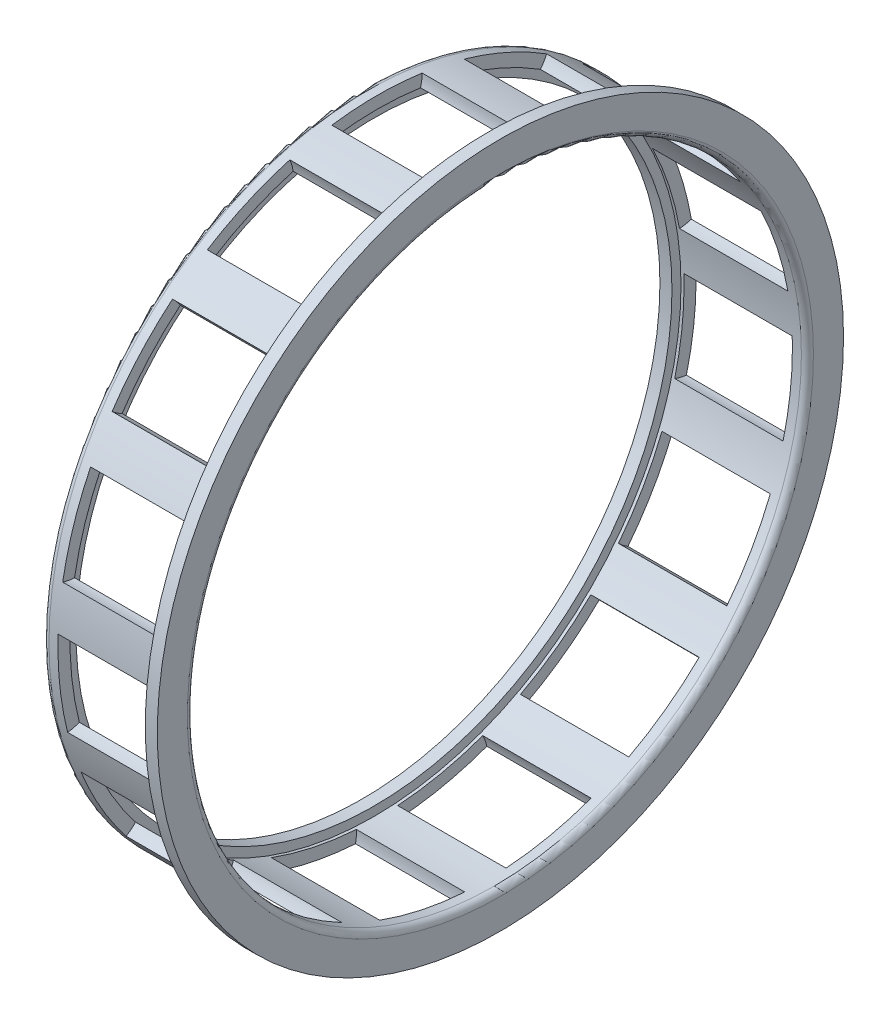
ISO-10303-21;
HEADER;
FILE_DESCRIPTION(('STEP AP214'),'2;1');
FILE_NAME('part.step','',(''),(''),'','','');
FILE_SCHEMA(('AUTOMOTIVE_DESIGN { 1 0 10303 214 1 1 1 1 }'));
ENDSEC;
DATA;
#1=APPLICATION_CONTEXT('core data for automotive mechanical design processes');
#2=APPLICATION_PROTOCOL_DEFINITION('international standard','automotive_design',2000,#1);
#3=PRODUCT_CONTEXT('',#1,'mechanical');
#4=PRODUCT('Part','Part','',(#3));
#5=PRODUCT_RELATED_PRODUCT_CATEGORY('part','',(#4));
#6=PRODUCT_DEFINITION_FORMATION('','',#4);
#7=PRODUCT_DEFINITION_CONTEXT('part definition',#1,'design');
#8=PRODUCT_DEFINITION('design','',#6,#7);
#9=PRODUCT_DEFINITION_SHAPE('','',#8);
#10=(LENGTH_UNIT() NAMED_UNIT(*) SI_UNIT(.MILLI.,.METRE.));
#11=(NAMED_UNIT(*) PLANE_ANGLE_UNIT() SI_UNIT($,.RADIAN.));
#12=(NAMED_UNIT(*) SI_UNIT($,.STERADIAN.) SOLID_ANGLE_UNIT());
#13=UNCERTAINTY_MEASURE_WITH_UNIT(LENGTH_MEASURE(1.E-05),#10,'distance_accuracy_value','');
#14=(GEOMETRIC_REPRESENTATION_CONTEXT(3) GLOBAL_UNCERTAINTY_ASSIGNED_CONTEXT((#13)) GLOBAL_UNIT_ASSIGNED_CONTEXT((#10,
#11,#12)) REPRESENTATION_CONTEXT('',''));
#15=CARTESIAN_POINT('',(0.,0.,0.));
#16=DIRECTION('',(0.,0.,1.));
#17=DIRECTION('',(1.,0.,0.));
#18=AXIS2_PLACEMENT_3D('',#15,#16,#17);
#19=CARTESIAN_POINT('',(-3.,0.,0.));
#20=DIRECTION('',(1.,0.,0.));
#21=DIRECTION('',(0.,0.,-1.));
#22=AXIS2_PLACEMENT_3D('',#19,#20,#21);
#23=CYLINDRICAL_SURFACE('',#22,11.4);
#24=CARTESIAN_POINT('',(4.2,0.,0.));
#25=DIRECTION('',(1.,0.,0.));
#26=DIRECTION('',(0.,0.,-1.));
#27=AXIS2_PLACEMENT_3D('',#24,#25,#26);
#28=CIRCLE('',#27,11.4);
#29=CARTESIAN_POINT('',(4.2,0.,-11.4));
#30=VERTEX_POINT('',#29);
#31=EDGE_CURVE('E668',#30,#30,#28,.T.);
#32=ORIENTED_EDGE('',*,*,#31,.T.);
#33=EDGE_LOOP('',(#32));
#34=FACE_BOUND('',#33,.T.);
#35=CARTESIAN_POINT('',(4.6,0.,0.));
#36=DIRECTION('',(1.,0.,0.));
#37=DIRECTION('',(0.,0.,-1.));
#38=AXIS2_PLACEMENT_3D('',#35,#36,#37);
#39=CIRCLE('',#38,11.4);
#40=CARTESIAN_POINT('',(4.6,0.,-11.4));
#41=VERTEX_POINT('',#40);
#42=EDGE_CURVE('E683',#41,#41,#39,.T.);
#43=ORIENTED_EDGE('',*,*,#42,.F.);
#44=EDGE_LOOP('',(#43));
#45=FACE_BOUND('',#44,.T.);
#46=ADVANCED_FACE('F31',(#34,#45),#23,.T.);
#47=CARTESIAN_POINT('',(4.6,10.6,0.));
#48=DIRECTION('',(1.,0.,0.));
#49=DIRECTION('',(0.,0.,-1.));
#50=AXIS2_PLACEMENT_3D('',#47,#48,#49);
#51=PLANE('',#50);
#52=CARTESIAN_POINT('',(4.6,0.,0.));
#53=DIRECTION('',(1.,0.,0.));
#54=DIRECTION('',(0.,0.,-1.));
#55=AXIS2_PLACEMENT_3D('',#52,#53,#54);
#56=CIRCLE('',#55,10.4);
#57=CARTESIAN_POINT('',(4.6,0.,-10.4));
#58=VERTEX_POINT('',#57);
#59=EDGE_CURVE('E695',#58,#58,#56,.F.);
#60=ORIENTED_EDGE('',*,*,#59,.T.);
#61=EDGE_LOOP('',(#60));
#62=FACE_BOUND('',#61,.T.);
#63=ORIENTED_EDGE('',*,*,#42,.T.);
#64=EDGE_LOOP('',(#63));
#65=FACE_BOUND('',#64,.T.);
#66=ADVANCED_FACE('F914',(#62,#65),#51,.T.);
#67=CARTESIAN_POINT('',(-3.,0.,0.));
#68=DIRECTION('',(1.,0.,0.));
#69=DIRECTION('',(0.,0.,-1.));
#70=AXIS2_PLACEMENT_3D('',#67,#68,#69);
#71=CYLINDRICAL_SURFACE('',#70,10.2);
#72=DIRECTION('',(-1.,0.,0.));
#73=VECTOR('',#72,1.);
#74=CARTESIAN_POINT('',(2.3,8.636509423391,5.42685037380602));
#75=LINE('',#74,#73);
#76=CARTESIAN_POINT('',(4.1,8.636509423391,5.42685037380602));
#77=VERTEX_POINT('',#76);
#78=CARTESIAN_POINT('',(0.5,8.636509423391,5.42685037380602));
#79=VERTEX_POINT('',#78);
#80=EDGE_CURVE('E409',#77,#79,#75,.T.);
#81=ORIENTED_EDGE('',*,*,#80,.F.);
#82=CARTESIAN_POINT('',(4.1,0.,0.));
#83=DIRECTION('',(-1.,0.,0.));
#84=DIRECTION('',(0.,0.,1.));
#85=AXIS2_PLACEMENT_3D('',#82,#83,#84);
#86=CIRCLE('',#85,10.2);
#87=CARTESIAN_POINT('',(4.1,9.81188856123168,2.78690560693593));
#88=VERTEX_POINT('',#87);
#89=EDGE_CURVE('E414',#77,#88,#86,.T.);
#90=ORIENTED_EDGE('',*,*,#89,.T.);
#91=DIRECTION('',(-1.,0.,0.));
#92=VECTOR('',#91,1.);
#93=CARTESIAN_POINT('',(2.3,9.81188856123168,2.78690560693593));
#94=LINE('',#93,#92);
#95=CARTESIAN_POINT('',(0.5,9.81188856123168,2.78690560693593));
#96=VERTEX_POINT('',#95);
#97=EDGE_CURVE('E404',#96,#88,#94,.F.);
#98=ORIENTED_EDGE('',*,*,#97,.F.);
#99=CARTESIAN_POINT('',(0.5,0.,0.));
#100=DIRECTION('',(1.,0.,0.));
#101=DIRECTION('',(0.,0.,-1.));
#102=AXIS2_PLACEMENT_3D('',#99,#100,#101);
#103=CIRCLE('',#102,10.2);
#104=EDGE_CURVE('E425',#96,#79,#103,.T.);
#105=ORIENTED_EDGE('',*,*,#104,.T.);
#106=EDGE_LOOP('',(#81,#90,#98,#105));
#107=FACE_BOUND('',#106,.T.);
#108=DIRECTION('',(-1.,0.,0.));
#109=VECTOR('',#108,1.);
#110=CARTESIAN_POINT('',(2.3,5.68254505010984,8.47045935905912));
#111=LINE('',#110,#109);
#112=CARTESIAN_POINT('',(4.1,5.68254505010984,8.47045935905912));
#113=VERTEX_POINT('',#112);
#114=CARTESIAN_POINT('',(0.5,5.68254505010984,8.47045935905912));
#115=VERTEX_POINT('',#114);
#116=EDGE_CURVE('E439',#113,#115,#111,.T.);
#117=ORIENTED_EDGE('',*,*,#116,.F.);
#118=CARTESIAN_POINT('',(4.1,0.,0.));
#119=DIRECTION('',(-1.,0.,0.));
#120=DIRECTION('',(0.,0.,1.));
#121=AXIS2_PLACEMENT_3D('',#118,#119,#120);
#122=CIRCLE('',#121,10.2);
#123=CARTESIAN_POINT('',(4.1,7.83006959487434,6.53681957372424));
#124=VERTEX_POINT('',#123);
#125=EDGE_CURVE('E444',#113,#124,#122,.T.);
#126=ORIENTED_EDGE('',*,*,#125,.T.);
#127=DIRECTION('',(-1.,0.,0.));
#128=VECTOR('',#127,1.);
#129=CARTESIAN_POINT('',(2.3,7.83006959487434,6.53681957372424));
#130=LINE('',#129,#128);
#131=CARTESIAN_POINT('',(0.5,7.83006959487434,6.53681957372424));
#132=VERTEX_POINT('',#131);
#133=EDGE_CURVE('E437',#132,#124,#130,.F.);
#134=ORIENTED_EDGE('',*,*,#133,.F.);
#135=CARTESIAN_POINT('',(0.5,0.,0.));
#136=DIRECTION('',(1.,0.,0.));
#137=DIRECTION('',(0.,0.,-1.));
#138=AXIS2_PLACEMENT_3D('',#135,#136,#137);
#139=CIRCLE('',#138,10.2);
#140=EDGE_CURVE('E441',#132,#115,#139,.T.);
#141=ORIENTED_EDGE('',*,*,#140,.T.);
#142=EDGE_LOOP('',(#117,#126,#134,#141));
#143=FACE_BOUND('',#142,.T.);
#144=DIRECTION('',(-1.,0.,0.));
#145=VECTOR('',#144,1.);
#146=CARTESIAN_POINT('',(2.3,1.74601701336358,10.0494489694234));
#147=LINE('',#146,#145);
#148=CARTESIAN_POINT('',(4.1,1.74601701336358,10.0494489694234));
#149=VERTEX_POINT('',#148);
#150=CARTESIAN_POINT('',(0.5,1.74601701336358,10.0494489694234));
#151=VERTEX_POINT('',#150);
#152=EDGE_CURVE('E456',#149,#151,#147,.T.);
#153=ORIENTED_EDGE('',*,*,#152,.F.);
#154=CARTESIAN_POINT('',(4.1,0.,0.));
#155=DIRECTION('',(-1.,0.,0.));
#156=DIRECTION('',(0.,0.,1.));
#157=AXIS2_PLACEMENT_3D('',#154,#155,#156);
#158=CIRCLE('',#157,10.2);
#159=CARTESIAN_POINT('',(4.1,4.49436046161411,9.15645805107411));
#160=VERTEX_POINT('',#159);
#161=EDGE_CURVE('E461',#149,#160,#158,.T.);
#162=ORIENTED_EDGE('',*,*,#161,.T.);
#163=DIRECTION('',(-1.,0.,0.));
#164=VECTOR('',#163,1.);
#165=CARTESIAN_POINT('',(2.3,4.49436046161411,9.15645805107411));
#166=LINE('',#165,#164);
#167=CARTESIAN_POINT('',(0.5,4.49436046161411,9.15645805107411));
#168=VERTEX_POINT('',#167);
#169=EDGE_CURVE('E454',#168,#160,#166,.F.);
#170=ORIENTED_EDGE('',*,*,#169,.F.);
#171=CARTESIAN_POINT('',(0.5,0.,0.));
#172=DIRECTION('',(1.,0.,0.));
#173=DIRECTION('',(0.,0.,-1.));
#174=AXIS2_PLACEMENT_3D('',#171,#172,#173);
#175=CIRCLE('',#174,10.2);
#176=EDGE_CURVE('E458',#168,#151,#175,.T.);
#177=ORIENTED_EDGE('',*,*,#176,.T.);
#178=EDGE_LOOP('',(#153,#162,#170,#177));
#179=FACE_BOUND('',#178,.T.);
#180=DIRECTION('',(-1.,0.,0.));
#181=VECTOR('',#180,1.);
#182=CARTESIAN_POINT('',(2.3,-2.49241322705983,9.8907975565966));
#183=LINE('',#182,#181);
#184=CARTESIAN_POINT('',(4.1,-2.49241322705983,9.8907975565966));
#185=VERTEX_POINT('',#184);
#186=CARTESIAN_POINT('',(0.5,-2.49241322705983,9.8907975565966));
#187=VERTEX_POINT('',#186);
#188=EDGE_CURVE('E473',#185,#187,#183,.T.);
#189=ORIENTED_EDGE('',*,*,#188,.F.);
#190=CARTESIAN_POINT('',(4.1,0.,0.));
#191=DIRECTION('',(-1.,0.,0.));
#192=DIRECTION('',(0.,0.,1.));
#193=AXIS2_PLACEMENT_3D('',#190,#191,#192);
#194=CIRCLE('',#193,10.2);
#195=CARTESIAN_POINT('',(4.1,0.381535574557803,10.1928617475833));
#196=VERTEX_POINT('',#195);
#197=EDGE_CURVE('E478',#185,#196,#194,.T.);
#198=ORIENTED_EDGE('',*,*,#197,.T.);
#199=DIRECTION('',(-1.,0.,0.));
#200=VECTOR('',#199,1.);
#201=CARTESIAN_POINT('',(2.3,0.381535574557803,10.1928617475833));
#202=LINE('',#201,#200);
#203=CARTESIAN_POINT('',(0.5,0.381535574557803,10.1928617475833));
#204=VERTEX_POINT('',#203);
#205=EDGE_CURVE('E471',#204,#196,#202,.F.);
#206=ORIENTED_EDGE('',*,*,#205,.F.);
#207=CARTESIAN_POINT('',(0.5,0.,0.));
#208=DIRECTION('',(1.,0.,0.));
#209=DIRECTION('',(0.,0.,-1.));
#210=AXIS2_PLACEMENT_3D('',#207,#208,#209);
#211=CIRCLE('',#210,10.2);
#212=EDGE_CURVE('E475',#204,#187,#211,.T.);
#213=ORIENTED_EDGE('',*,*,#212,.T.);
#214=EDGE_LOOP('',(#189,#198,#206,#213));
#215=FACE_BOUND('',#214,.T.);
#216=DIRECTION('',(-1.,0.,0.));
#217=VECTOR('',#216,1.);
#218=CARTESIAN_POINT('',(2.3,-6.29988257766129,8.02193739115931));
#219=LINE('',#218,#217);
#220=CARTESIAN_POINT('',(4.1,-6.29988257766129,8.02193739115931));
#221=VERTEX_POINT('',#220);
#222=CARTESIAN_POINT('',(0.5,-6.29988257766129,8.02193739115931));
#223=VERTEX_POINT('',#222);
#224=EDGE_CURVE('E490',#221,#223,#219,.T.);
#225=ORIENTED_EDGE('',*,*,#224,.F.);
#226=CARTESIAN_POINT('',(4.1,0.,0.));
#227=DIRECTION('',(-1.,0.,0.));
#228=DIRECTION('',(0.,0.,1.));
#229=AXIS2_PLACEMENT_3D('',#226,#227,#228);
#230=CIRCLE('',#229,10.2);
#231=CARTESIAN_POINT('',(4.1,-3.79726027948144,9.46682704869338));
#232=VERTEX_POINT('',#231);
#233=EDGE_CURVE('E495',#221,#232,#230,.T.);
#234=ORIENTED_EDGE('',*,*,#233,.T.);
#235=DIRECTION('',(-1.,0.,0.));
#236=VECTOR('',#235,1.);
#237=CARTESIAN_POINT('',(2.3,-3.79726027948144,9.46682704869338));
#238=LINE('',#237,#236);
#239=CARTESIAN_POINT('',(0.5,-3.79726027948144,9.46682704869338));
#240=VERTEX_POINT('',#239);
#241=EDGE_CURVE('E488',#240,#232,#238,.F.);
#242=ORIENTED_EDGE('',*,*,#241,.F.);
#243=CARTESIAN_POINT('',(0.5,0.,0.));
#244=DIRECTION('',(1.,0.,0.));
#245=DIRECTION('',(0.,0.,-1.));
#246=AXIS2_PLACEMENT_3D('',#243,#244,#245);
#247=CIRCLE('',#246,10.2);
#248=EDGE_CURVE('E492',#240,#223,#247,.T.);
#249=ORIENTED_EDGE('',*,*,#248,.T.);
#250=EDGE_LOOP('',(#225,#234,#242,#249));
#251=FACE_BOUND('',#250,.T.);
#252=DIRECTION('',(-1.,0.,0.));
#253=VECTOR('',#252,1.);
#254=CARTESIAN_POINT('',(2.3,-9.01804499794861,4.76601137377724));
#255=LINE('',#254,#253);
#256=CARTESIAN_POINT('',(4.1,-9.01804499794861,4.76601137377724));
#257=VERTEX_POINT('',#256);
#258=CARTESIAN_POINT('',(0.5,-9.01804499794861,4.76601137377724));
#259=VERTEX_POINT('',#258);
#260=EDGE_CURVE('E507',#257,#259,#255,.T.);
#261=ORIENTED_EDGE('',*,*,#260,.F.);
#262=CARTESIAN_POINT('',(4.1,0.,0.));
#263=DIRECTION('',(-1.,0.,0.));
#264=DIRECTION('',(0.,0.,1.));
#265=AXIS2_PLACEMENT_3D('',#262,#263,#264);
#266=CIRCLE('',#265,10.2);
#267=CARTESIAN_POINT('',(4.1,-7.31947533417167,7.10389194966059));
#268=VERTEX_POINT('',#267);
#269=EDGE_CURVE('E512',#257,#268,#266,.T.);
#270=ORIENTED_EDGE('',*,*,#269,.T.);
#271=DIRECTION('',(-1.,0.,0.));
#272=VECTOR('',#271,1.);
#273=CARTESIAN_POINT('',(2.3,-7.31947533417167,7.10389194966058));
#274=LINE('',#273,#272);
#275=CARTESIAN_POINT('',(0.5,-7.31947533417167,7.10389194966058));
#276=VERTEX_POINT('',#275);
#277=EDGE_CURVE('E505',#276,#268,#274,.F.);
#278=ORIENTED_EDGE('',*,*,#277,.F.);
#279=CARTESIAN_POINT('',(0.5,0.,0.));
#280=DIRECTION('',(1.,0.,0.));
#281=DIRECTION('',(0.,0.,-1.));
#282=AXIS2_PLACEMENT_3D('',#279,#280,#281);
#283=CIRCLE('',#282,10.2);
#284=EDGE_CURVE('E509',#276,#259,#283,.T.);
#285=ORIENTED_EDGE('',*,*,#284,.T.);
#286=EDGE_LOOP('',(#261,#270,#278,#285));
#287=FACE_BOUND('',#286,.T.);
#288=DIRECTION('',(-1.,0.,0.));
#289=VECTOR('',#288,1.);
#290=CARTESIAN_POINT('',(2.3,-10.1769055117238,0.685998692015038));
#291=LINE('',#290,#289);
#292=CARTESIAN_POINT('',(4.1,-10.1769055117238,0.685998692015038));
#293=VERTEX_POINT('',#292);
#294=CARTESIAN_POINT('',(0.5,-10.1769055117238,0.685998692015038));
#295=VERTEX_POINT('',#294);
#296=EDGE_CURVE('E524',#293,#295,#291,.T.);
#297=ORIENTED_EDGE('',*,*,#296,.F.);
#298=CARTESIAN_POINT('',(4.1,0.,0.));
#299=DIRECTION('',(-1.,0.,0.));
#300=DIRECTION('',(0.,0.,1.));
#301=AXIS2_PLACEMENT_3D('',#298,#299,#300);
#302=CIRCLE('',#301,10.2);
#303=CARTESIAN_POINT('',(4.1,-9.57608660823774,3.51262939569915));
#304=VERTEX_POINT('',#303);
#305=EDGE_CURVE('E529',#293,#304,#302,.T.);
#306=ORIENTED_EDGE('',*,*,#305,.T.);
#307=DIRECTION('',(-1.,0.,0.));
#308=VECTOR('',#307,1.);
#309=CARTESIAN_POINT('',(2.3,-9.57608660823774,3.51262939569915));
#310=LINE('',#309,#308);
#311=CARTESIAN_POINT('',(0.5,-9.57608660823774,3.51262939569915));
#312=VERTEX_POINT('',#311);
#313=EDGE_CURVE('E522',#312,#304,#310,.F.);
#314=ORIENTED_EDGE('',*,*,#313,.F.);
#315=CARTESIAN_POINT('',(0.5,0.,0.));
#316=DIRECTION('',(1.,0.,0.));
#317=DIRECTION('',(0.,0.,-1.));
#318=AXIS2_PLACEMENT_3D('',#315,#316,#317);
#319=CIRCLE('',#318,10.2);
#320=EDGE_CURVE('E526',#312,#295,#319,.T.);
#321=ORIENTED_EDGE('',*,*,#320,.T.);
#322=EDGE_LOOP('',(#297,#306,#314,#321));
#323=FACE_BOUND('',#322,.T.);
#324=DIRECTION('',(-1.,0.,0.));
#325=VECTOR('',#324,1.);
#326=CARTESIAN_POINT('',(2.3,-9.57608660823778,-3.51262939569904));
#327=LINE('',#326,#325);
#328=CARTESIAN_POINT('',(4.1,-9.57608660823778,-3.51262939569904));
#329=VERTEX_POINT('',#328);
#330=CARTESIAN_POINT('',(0.5,-9.57608660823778,-3.51262939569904));
#331=VERTEX_POINT('',#330);
#332=EDGE_CURVE('E541',#329,#331,#327,.T.);
#333=ORIENTED_EDGE('',*,*,#332,.F.);
#334=CARTESIAN_POINT('',(4.1,0.,0.));
#335=DIRECTION('',(-1.,0.,0.));
#336=DIRECTION('',(0.,0.,1.));
#337=AXIS2_PLACEMENT_3D('',#334,#335,#336);
#338=CIRCLE('',#337,10.2);
#339=CARTESIAN_POINT('',(4.1,-10.1769055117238,-0.685998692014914));
#340=VERTEX_POINT('',#339);
#341=EDGE_CURVE('E546',#329,#340,#338,.T.);
#342=ORIENTED_EDGE('',*,*,#341,.T.);
#343=DIRECTION('',(-1.,0.,0.));
#344=VECTOR('',#343,1.);
#345=CARTESIAN_POINT('',(2.3,-10.1769055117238,-0.685998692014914));
#346=LINE('',#345,#344);
#347=CARTESIAN_POINT('',(0.5,-10.1769055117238,-0.685998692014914));
#348=VERTEX_POINT('',#347);
#349=EDGE_CURVE('E539',#348,#340,#346,.F.);
#350=ORIENTED_EDGE('',*,*,#349,.F.);
#351=CARTESIAN_POINT('',(0.5,0.,0.));
#352=DIRECTION('',(1.,0.,0.));
#353=DIRECTION('',(0.,0.,-1.));
#354=AXIS2_PLACEMENT_3D('',#351,#352,#353);
#355=CIRCLE('',#354,10.2);
#356=EDGE_CURVE('E543',#348,#331,#355,.T.);
#357=ORIENTED_EDGE('',*,*,#356,.T.);
#358=EDGE_LOOP('',(#333,#342,#350,#357));
#359=FACE_BOUND('',#358,.T.);
#360=DIRECTION('',(-1.,0.,0.));
#361=VECTOR('',#360,1.);
#362=CARTESIAN_POINT('',(2.3,-7.31947533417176,-7.1038919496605));
#363=LINE('',#362,#361);
#364=CARTESIAN_POINT('',(4.1,-7.31947533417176,-7.1038919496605));
#365=VERTEX_POINT('',#364);
#366=CARTESIAN_POINT('',(0.5,-7.31947533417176,-7.1038919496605));
#367=VERTEX_POINT('',#366);
#368=EDGE_CURVE('E558',#365,#367,#363,.T.);
#369=ORIENTED_EDGE('',*,*,#368,.F.);
#370=CARTESIAN_POINT('',(4.1,0.,0.));
#371=DIRECTION('',(-1.,0.,0.));
#372=DIRECTION('',(0.,0.,1.));
#373=AXIS2_PLACEMENT_3D('',#370,#371,#372);
#374=CIRCLE('',#373,10.2);
#375=CARTESIAN_POINT('',(4.1,-9.01804499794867,-4.76601137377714));
#376=VERTEX_POINT('',#375);
#377=EDGE_CURVE('E563',#365,#376,#374,.T.);
#378=ORIENTED_EDGE('',*,*,#377,.T.);
#379=DIRECTION('',(-1.,0.,0.));
#380=VECTOR('',#379,1.);
#381=CARTESIAN_POINT('',(2.3,-9.01804499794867,-4.76601137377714));
#382=LINE('',#381,#380);
#383=CARTESIAN_POINT('',(0.5,-9.01804499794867,-4.76601137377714));
#384=VERTEX_POINT('',#383);
#385=EDGE_CURVE('E556',#384,#376,#382,.F.);
#386=ORIENTED_EDGE('',*,*,#385,.F.);
#387=CARTESIAN_POINT('',(0.5,0.,0.));
#388=DIRECTION('',(1.,0.,0.));
#389=DIRECTION('',(0.,0.,-1.));
#390=AXIS2_PLACEMENT_3D('',#387,#388,#389);
#391=CIRCLE('',#390,10.2);
#392=EDGE_CURVE('E560',#384,#367,#391,.T.);
#393=ORIENTED_EDGE('',*,*,#392,.T.);
#394=EDGE_LOOP('',(#369,#378,#386,#393));
#395=FACE_BOUND('',#394,.T.);
#396=DIRECTION('',(-1.,0.,0.));
#397=VECTOR('',#396,1.);
#398=CARTESIAN_POINT('',(2.3,-3.79726027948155,-9.46682704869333));
#399=LINE('',#398,#397);
#400=CARTESIAN_POINT('',(4.1,-3.79726027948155,-9.46682704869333));
#401=VERTEX_POINT('',#400);
#402=CARTESIAN_POINT('',(0.5,-3.79726027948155,-9.46682704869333));
#403=VERTEX_POINT('',#402);
#404=EDGE_CURVE('E575',#401,#403,#399,.T.);
#405=ORIENTED_EDGE('',*,*,#404,.F.);
#406=CARTESIAN_POINT('',(4.1,0.,0.));
#407=DIRECTION('',(-1.,0.,0.));
#408=DIRECTION('',(0.,0.,1.));
#409=AXIS2_PLACEMENT_3D('',#406,#407,#408);
#410=CIRCLE('',#409,10.2);
#411=CARTESIAN_POINT('',(4.1,-6.29988257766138,-8.02193739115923));
#412=VERTEX_POINT('',#411);
#413=EDGE_CURVE('E580',#401,#412,#410,.T.);
#414=ORIENTED_EDGE('',*,*,#413,.T.);
#415=DIRECTION('',(-1.,0.,0.));
#416=VECTOR('',#415,1.);
#417=CARTESIAN_POINT('',(2.3,-6.29988257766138,-8.02193739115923));
#418=LINE('',#417,#416);
#419=CARTESIAN_POINT('',(0.5,-6.29988257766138,-8.02193739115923));
#420=VERTEX_POINT('',#419);
#421=EDGE_CURVE('E573',#420,#412,#418,.F.);
#422=ORIENTED_EDGE('',*,*,#421,.F.);
#423=CARTESIAN_POINT('',(0.5,0.,0.));
#424=DIRECTION('',(1.,0.,0.));
#425=DIRECTION('',(0.,0.,-1.));
#426=AXIS2_PLACEMENT_3D('',#423,#424,#425);
#427=CIRCLE('',#426,10.2);
#428=EDGE_CURVE('E577',#420,#403,#427,.T.);
#429=ORIENTED_EDGE('',*,*,#428,.T.);
#430=EDGE_LOOP('',(#405,#414,#422,#429));
#431=FACE_BOUND('',#430,.T.);
#432=DIRECTION('',(-1.,0.,0.));
#433=VECTOR('',#432,1.);
#434=CARTESIAN_POINT('',(2.3,0.381535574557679,-10.1928617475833));
#435=LINE('',#434,#433);
#436=CARTESIAN_POINT('',(4.1,0.381535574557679,-10.1928617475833));
#437=VERTEX_POINT('',#436);
#438=CARTESIAN_POINT('',(0.5,0.381535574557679,-10.1928617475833));
#439=VERTEX_POINT('',#438);
#440=EDGE_CURVE('E592',#437,#439,#435,.T.);
#441=ORIENTED_EDGE('',*,*,#440,.F.);
#442=CARTESIAN_POINT('',(4.1,0.,0.));
#443=DIRECTION('',(-1.,0.,0.));
#444=DIRECTION('',(0.,0.,1.));
#445=AXIS2_PLACEMENT_3D('',#442,#443,#444);
#446=CIRCLE('',#445,10.2);
#447=CARTESIAN_POINT('',(4.1,-2.49241322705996,-9.89079755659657));
#448=VERTEX_POINT('',#447);
#449=EDGE_CURVE('E597',#437,#448,#446,.T.);
#450=ORIENTED_EDGE('',*,*,#449,.T.);
#451=DIRECTION('',(-1.,0.,0.));
#452=VECTOR('',#451,1.);
#453=CARTESIAN_POINT('',(2.3,-2.49241322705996,-9.89079755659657));
#454=LINE('',#453,#452);
#455=CARTESIAN_POINT('',(0.5,-2.49241322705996,-9.89079755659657));
#456=VERTEX_POINT('',#455);
#457=EDGE_CURVE('E590',#456,#448,#454,.F.);
#458=ORIENTED_EDGE('',*,*,#457,.F.);
#459=CARTESIAN_POINT('',(0.5,0.,0.));
#460=DIRECTION('',(1.,0.,0.));
#461=DIRECTION('',(0.,0.,-1.));
#462=AXIS2_PLACEMENT_3D('',#459,#460,#461);
#463=CIRCLE('',#462,10.2);
#464=EDGE_CURVE('E594',#456,#439,#463,.T.);
#465=ORIENTED_EDGE('',*,*,#464,.T.);
#466=EDGE_LOOP('',(#441,#450,#458,#465));
#467=FACE_BOUND('',#466,.T.);
#468=DIRECTION('',(-1.,0.,0.));
#469=VECTOR('',#468,1.);
#470=CARTESIAN_POINT('',(2.3,4.494360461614,-9.15645805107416));
#471=LINE('',#470,#469);
#472=CARTESIAN_POINT('',(4.1,4.494360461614,-9.15645805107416));
#473=VERTEX_POINT('',#472);
#474=CARTESIAN_POINT('',(0.5,4.494360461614,-9.15645805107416));
#475=VERTEX_POINT('',#474);
#476=EDGE_CURVE('E609',#473,#475,#471,.T.);
#477=ORIENTED_EDGE('',*,*,#476,.F.);
#478=CARTESIAN_POINT('',(4.1,0.,0.));
#479=DIRECTION('',(-1.,0.,0.));
#480=DIRECTION('',(0.,0.,1.));
#481=AXIS2_PLACEMENT_3D('',#478,#479,#480);
#482=CIRCLE('',#481,10.2);
#483=CARTESIAN_POINT('',(4.1,1.74601701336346,-10.0494489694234));
#484=VERTEX_POINT('',#483);
#485=EDGE_CURVE('E614',#473,#484,#482,.T.);
#486=ORIENTED_EDGE('',*,*,#485,.T.);
#487=DIRECTION('',(-1.,0.,0.));
#488=VECTOR('',#487,1.);
#489=CARTESIAN_POINT('',(2.3,1.74601701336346,-10.0494489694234));
#490=LINE('',#489,#488);
#491=CARTESIAN_POINT('',(0.5,1.74601701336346,-10.0494489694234));
#492=VERTEX_POINT('',#491);
#493=EDGE_CURVE('E607',#492,#484,#490,.F.);
#494=ORIENTED_EDGE('',*,*,#493,.F.);
#495=CARTESIAN_POINT('',(0.5,0.,0.));
#496=DIRECTION('',(1.,0.,0.));
#497=DIRECTION('',(0.,0.,-1.));
#498=AXIS2_PLACEMENT_3D('',#495,#496,#497);
#499=CIRCLE('',#498,10.2);
#500=EDGE_CURVE('E611',#492,#475,#499,.T.);
#501=ORIENTED_EDGE('',*,*,#500,.T.);
#502=EDGE_LOOP('',(#477,#486,#494,#501));
#503=FACE_BOUND('',#502,.T.);
#504=DIRECTION('',(-1.,0.,0.));
#505=VECTOR('',#504,1.);
#506=CARTESIAN_POINT('',(2.3,7.83006959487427,-6.53681957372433));
#507=LINE('',#506,#505);
#508=CARTESIAN_POINT('',(4.1,7.83006959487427,-6.53681957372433));
#509=VERTEX_POINT('',#508);
#510=CARTESIAN_POINT('',(0.5,7.83006959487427,-6.53681957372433));
#511=VERTEX_POINT('',#510);
#512=EDGE_CURVE('E626',#509,#511,#507,.T.);
#513=ORIENTED_EDGE('',*,*,#512,.F.);
#514=CARTESIAN_POINT('',(4.1,0.,0.));
#515=DIRECTION('',(-1.,0.,0.));
#516=DIRECTION('',(0.,0.,1.));
#517=AXIS2_PLACEMENT_3D('',#514,#515,#516);
#518=CIRCLE('',#517,10.2);
#519=CARTESIAN_POINT('',(4.1,5.68254505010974,-8.47045935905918));
#520=VERTEX_POINT('',#519);
#521=EDGE_CURVE('E631',#509,#520,#518,.T.);
#522=ORIENTED_EDGE('',*,*,#521,.T.);
#523=DIRECTION('',(-1.,0.,0.));
#524=VECTOR('',#523,1.);
#525=CARTESIAN_POINT('',(2.3,5.68254505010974,-8.47045935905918));
#526=LINE('',#525,#524);
#527=CARTESIAN_POINT('',(0.5,5.68254505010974,-8.47045935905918));
#528=VERTEX_POINT('',#527);
#529=EDGE_CURVE('E624',#528,#520,#526,.F.);
#530=ORIENTED_EDGE('',*,*,#529,.F.);
#531=CARTESIAN_POINT('',(0.5,0.,0.));
#532=DIRECTION('',(1.,0.,0.));
#533=DIRECTION('',(0.,0.,-1.));
#534=AXIS2_PLACEMENT_3D('',#531,#532,#533);
#535=CIRCLE('',#534,10.2);
#536=EDGE_CURVE('E628',#528,#511,#535,.T.);
#537=ORIENTED_EDGE('',*,*,#536,.T.);
#538=EDGE_LOOP('',(#513,#522,#530,#537));
#539=FACE_BOUND('',#538,.T.);
#540=DIRECTION('',(-1.,0.,0.));
#541=VECTOR('',#540,1.);
#542=CARTESIAN_POINT('',(2.3,9.81188856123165,-2.78690560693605));
#543=LINE('',#542,#541);
#544=CARTESIAN_POINT('',(4.1,9.81188856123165,-2.78690560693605));
#545=VERTEX_POINT('',#544);
#546=CARTESIAN_POINT('',(0.5,9.81188856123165,-2.78690560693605));
#547=VERTEX_POINT('',#546);
#548=EDGE_CURVE('E643',#545,#547,#543,.T.);
#549=ORIENTED_EDGE('',*,*,#548,.F.);
#550=CARTESIAN_POINT('',(4.1,0.,0.));
#551=DIRECTION('',(-1.,0.,0.));
#552=DIRECTION('',(0.,0.,1.));
#553=AXIS2_PLACEMENT_3D('',#550,#551,#552);
#554=CIRCLE('',#553,10.2);
#555=CARTESIAN_POINT('',(4.1,8.63650942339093,-5.42685037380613));
#556=VERTEX_POINT('',#555);
#557=EDGE_CURVE('E648',#545,#556,#554,.T.);
#558=ORIENTED_EDGE('',*,*,#557,.T.);
#559=DIRECTION('',(-1.,0.,0.));
#560=VECTOR('',#559,1.);
#561=CARTESIAN_POINT('',(2.3,8.63650942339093,-5.42685037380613));
#562=LINE('',#561,#560);
#563=CARTESIAN_POINT('',(0.5,8.63650942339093,-5.42685037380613));
#564=VERTEX_POINT('',#563);
#565=EDGE_CURVE('E641',#564,#556,#562,.F.);
#566=ORIENTED_EDGE('',*,*,#565,.F.);
#567=CARTESIAN_POINT('',(0.5,0.,0.));
#568=DIRECTION('',(1.,0.,0.));
#569=DIRECTION('',(0.,0.,-1.));
#570=AXIS2_PLACEMENT_3D('',#567,#568,#569);
#571=CIRCLE('',#570,10.2);
#572=EDGE_CURVE('E645',#564,#547,#571,.T.);
#573=ORIENTED_EDGE('',*,*,#572,.T.);
#574=EDGE_LOOP('',(#549,#558,#566,#573));
#575=FACE_BOUND('',#574,.T.);
#576=DIRECTION('',(-1.,0.,0.));
#577=VECTOR('',#576,1.);
#578=CARTESIAN_POINT('',(2.3,10.0971428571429,1.44488965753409));
#579=LINE('',#578,#577);
#580=CARTESIAN_POINT('',(4.1,10.0971428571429,1.44488965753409));
#581=VERTEX_POINT('',#580);
#582=CARTESIAN_POINT('',(0.5,10.0971428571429,1.44488965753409));
#583=VERTEX_POINT('',#582);
#584=EDGE_CURVE('E660',#581,#583,#579,.T.);
#585=ORIENTED_EDGE('',*,*,#584,.F.);
#586=CARTESIAN_POINT('',(4.1,0.,0.));
#587=DIRECTION('',(-1.,0.,0.));
#588=DIRECTION('',(0.,0.,1.));
#589=AXIS2_PLACEMENT_3D('',#586,#587,#588);
#590=CIRCLE('',#589,10.2);
#591=CARTESIAN_POINT('',(4.1,10.0971428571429,-1.44488965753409));
#592=VERTEX_POINT('',#591);
#593=EDGE_CURVE('E665',#581,#592,#590,.T.);
#594=ORIENTED_EDGE('',*,*,#593,.T.);
#595=DIRECTION('',(-1.,0.,0.));
#596=VECTOR('',#595,1.);
#597=CARTESIAN_POINT('',(2.3,10.0971428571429,-1.44488965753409));
#598=LINE('',#597,#596);
#599=CARTESIAN_POINT('',(0.5,10.0971428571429,-1.44488965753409));
#600=VERTEX_POINT('',#599);
#601=EDGE_CURVE('E658',#600,#592,#598,.F.);
#602=ORIENTED_EDGE('',*,*,#601,.F.);
#603=CARTESIAN_POINT('',(0.5,0.,0.));
#604=DIRECTION('',(1.,0.,0.));
#605=DIRECTION('',(0.,0.,-1.));
#606=AXIS2_PLACEMENT_3D('',#603,#604,#605);
#607=CIRCLE('',#606,10.2);
#608=EDGE_CURVE('E662',#600,#583,#607,.T.);
#609=ORIENTED_EDGE('',*,*,#608,.T.);
#610=EDGE_LOOP('',(#585,#594,#602,#609));
#611=FACE_BOUND('',#610,.T.);
#612=CARTESIAN_POINT('',(4.4,0.,0.));
#613=DIRECTION('',(1.,0.,0.));
#614=DIRECTION('',(0.,0.,-1.));
#615=AXIS2_PLACEMENT_3D('',#612,#613,#614);
#616=CIRCLE('',#615,10.2);
#617=CARTESIAN_POINT('',(4.4,0.,-10.2));
#618=VERTEX_POINT('',#617);
#619=EDGE_CURVE('E692',#618,#618,#616,.T.);
#620=ORIENTED_EDGE('',*,*,#619,.T.);
#621=EDGE_LOOP('',(#620));
#622=FACE_BOUND('',#621,.T.);
#623=CARTESIAN_POINT('',(0.4,0.,0.));
#624=DIRECTION('',(1.,0.,0.));
#625=DIRECTION('',(0.,0.,-1.));
#626=AXIS2_PLACEMENT_3D('',#623,#624,#625);
#627=CIRCLE('',#626,10.2);
#628=CARTESIAN_POINT('',(0.4,0.,-10.2));
#629=VERTEX_POINT('',#628);
#630=EDGE_CURVE('E680',#629,#629,#627,.T.);
#631=ORIENTED_EDGE('',*,*,#630,.F.);
#632=EDGE_LOOP('',(#631));
#633=FACE_BOUND('',#632,.T.);
#634=ADVANCED_FACE('F422',(#107,#143,#179,#215,#251,#287,#323,#359,#395,#431,#467,#503,#539,
#575,#611,#622,#633),#71,.F.);
#635=CARTESIAN_POINT('',(0.4,10.6,0.));
#636=DIRECTION('',(-1.,0.,0.));
#637=DIRECTION('',(0.,0.,1.));
#638=AXIS2_PLACEMENT_3D('',#635,#636,#637);
#639=PLANE('',#638);
#640=CARTESIAN_POINT('',(0.4,0.,0.));
#641=DIRECTION('',(1.,0.,0.));
#642=DIRECTION('',(0.,0.,-1.));
#643=AXIS2_PLACEMENT_3D('',#640,#641,#642);
#644=CIRCLE('',#643,9.9);
#645=CARTESIAN_POINT('',(0.4,0.,-9.9));
#646=VERTEX_POINT('',#645);
#647=EDGE_CURVE('E677',#646,#646,#644,.T.);
#648=ORIENTED_EDGE('',*,*,#647,.F.);
#649=EDGE_LOOP('',(#648));
#650=FACE_BOUND('',#649,.T.);
#651=ORIENTED_EDGE('',*,*,#630,.T.);
#652=EDGE_LOOP('',(#651));
#653=FACE_BOUND('',#652,.T.);
#654=ADVANCED_FACE('F926',(#650,#653),#639,.F.);
#655=CARTESIAN_POINT('',(-3.,0.,0.));
#656=DIRECTION('',(1.,0.,0.));
#657=DIRECTION('',(0.,0.,-1.));
#658=AXIS2_PLACEMENT_3D('',#655,#656,#657);
#659=CYLINDRICAL_SURFACE('',#658,9.9);
#660=CARTESIAN_POINT('',(0.,0.,0.));
#661=DIRECTION('',(1.,0.,0.));
#662=DIRECTION('',(0.,0.,-1.));
#663=AXIS2_PLACEMENT_3D('',#660,#661,#662);
#664=CIRCLE('',#663,9.9);
#665=CARTESIAN_POINT('',(0.,0.,-9.9));
#666=VERTEX_POINT('',#665);
#667=EDGE_CURVE('E674',#666,#666,#664,.T.);
#668=ORIENTED_EDGE('',*,*,#667,.F.);
#669=EDGE_LOOP('',(#668));
#670=FACE_BOUND('',#669,.T.);
#671=ORIENTED_EDGE('',*,*,#647,.T.);
#672=EDGE_LOOP('',(#671));
#673=FACE_BOUND('',#672,.T.);
#674=ADVANCED_FACE('F931',(#670,#673),#659,.F.);
#675=CARTESIAN_POINT('',(0.,10.6,0.));
#676=DIRECTION('',(-1.,0.,0.));
#677=DIRECTION('',(0.,0.,1.));
#678=AXIS2_PLACEMENT_3D('',#675,#676,#677);
#679=PLANE('',#678);
#680=CARTESIAN_POINT('',(0.,0.,0.));
#681=DIRECTION('',(-1.,0.,0.));
#682=DIRECTION('',(0.,0.,1.));
#683=AXIS2_PLACEMENT_3D('',#680,#681,#682);
#684=CIRCLE('',#683,10.4);
#685=CARTESIAN_POINT('',(0.,0.,10.4));
#686=VERTEX_POINT('',#685);
#687=EDGE_CURVE('E689',#686,#686,#684,.T.);
#688=ORIENTED_EDGE('',*,*,#687,.T.);
#689=EDGE_LOOP('',(#688));
#690=FACE_BOUND('',#689,.T.);
#691=ORIENTED_EDGE('',*,*,#667,.T.);
#692=EDGE_LOOP('',(#691));
#693=FACE_BOUND('',#692,.T.);
#694=ADVANCED_FACE('F868',(#690,#693),#679,.T.);
#695=CARTESIAN_POINT('',(-3.,0.,0.));
#696=DIRECTION('',(1.,0.,0.));
#697=DIRECTION('',(0.,0.,-1.));
#698=AXIS2_PLACEMENT_3D('',#695,#696,#697);
#699=CYLINDRICAL_SURFACE('',#698,10.6);
#700=CARTESIAN_POINT('',(4.1,0.,0.));
#701=DIRECTION('',(-1.,0.,0.));
#702=DIRECTION('',(0.,0.,1.));
#703=AXIS2_PLACEMENT_3D('',#700,#701,#702);
#704=CIRCLE('',#703,10.6);
#705=CARTESIAN_POINT('',(4.1,8.97603806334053,5.63832782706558));
#706=VERTEX_POINT('',#705);
#707=CARTESIAN_POINT('',(4.1,10.1962359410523,2.89771852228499));
#708=VERTEX_POINT('',#707);
#709=EDGE_CURVE('E38',#706,#708,#704,.T.);
#710=ORIENTED_EDGE('',*,*,#709,.F.);
#711=DIRECTION('',(-1.,0.,0.));
#712=VECTOR('',#711,1.);
#713=CARTESIAN_POINT('',(2.3,8.97603806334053,5.63832782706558));
#714=LINE('',#713,#712);
#715=CARTESIAN_POINT('',(0.5,8.97603806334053,5.63832782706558));
#716=VERTEX_POINT('',#715);
#717=EDGE_CURVE('E11',#706,#716,#714,.T.);
#718=ORIENTED_EDGE('',*,*,#717,.T.);
#719=CARTESIAN_POINT('',(0.5,0.,0.));
#720=DIRECTION('',(1.,0.,0.));
#721=DIRECTION('',(0.,0.,-1.));
#722=AXIS2_PLACEMENT_3D('',#719,#720,#721);
#723=CIRCLE('',#722,10.6);
#724=CARTESIAN_POINT('',(0.5,10.1962359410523,2.89771852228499));
#725=VERTEX_POINT('',#724);
#726=EDGE_CURVE('E854',#725,#716,#723,.T.);
#727=ORIENTED_EDGE('',*,*,#726,.F.);
#728=DIRECTION('',(-1.,0.,0.));
#729=VECTOR('',#728,1.);
#730=CARTESIAN_POINT('',(2.3,10.1962359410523,2.89771852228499));
#731=LINE('',#730,#729);
#732=EDGE_CURVE('E852',#725,#708,#731,.F.);
#733=ORIENTED_EDGE('',*,*,#732,.T.);
#734=EDGE_LOOP('',(#710,#718,#727,#733));
#735=FACE_BOUND('',#734,.T.);
#736=CARTESIAN_POINT('',(4.1,0.,0.));
#737=DIRECTION('',(-1.,0.,0.));
#738=DIRECTION('',(0.,0.,1.));
#739=AXIS2_PLACEMENT_3D('',#736,#737,#738);
#740=CIRCLE('',#739,10.6);
#741=CARTESIAN_POINT('',(4.1,5.90670426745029,8.80175236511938));
#742=VERTEX_POINT('',#741);
#743=CARTESIAN_POINT('',(4.1,8.13611672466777,6.79438037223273));
#744=VERTEX_POINT('',#743);
#745=EDGE_CURVE('E846',#742,#744,#740,.T.);
#746=ORIENTED_EDGE('',*,*,#745,.F.);
#747=DIRECTION('',(-1.,0.,0.));
#748=VECTOR('',#747,1.);
#749=CARTESIAN_POINT('',(2.3,5.90670426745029,8.80175236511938));
#750=LINE('',#749,#748);
#751=CARTESIAN_POINT('',(0.5,5.90670426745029,8.80175236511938));
#752=VERTEX_POINT('',#751);
#753=EDGE_CURVE('E849',#742,#752,#750,.T.);
#754=ORIENTED_EDGE('',*,*,#753,.T.);
#755=CARTESIAN_POINT('',(0.5,0.,0.));
#756=DIRECTION('',(1.,0.,0.));
#757=DIRECTION('',(0.,0.,-1.));
#758=AXIS2_PLACEMENT_3D('',#755,#756,#757);
#759=CIRCLE('',#758,10.6);
#760=CARTESIAN_POINT('',(0.5,8.13611672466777,6.79438037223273));
#761=VERTEX_POINT('',#760);
#762=EDGE_CURVE('E844',#761,#752,#759,.T.);
#763=ORIENTED_EDGE('',*,*,#762,.F.);
#764=DIRECTION('',(-1.,0.,0.));
#765=VECTOR('',#764,1.);
#766=CARTESIAN_POINT('',(2.3,8.13611672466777,6.79438037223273));
#767=LINE('',#766,#765);
#768=EDGE_CURVE('E841',#761,#744,#767,.F.);
#769=ORIENTED_EDGE('',*,*,#768,.T.);
#770=EDGE_LOOP('',(#746,#754,#763,#769));
#771=FACE_BOUND('',#770,.T.);
#772=CARTESIAN_POINT('',(4.1,0.,0.));
#773=DIRECTION('',(-1.,0.,0.));
#774=DIRECTION('',(0.,0.,1.));
#775=AXIS2_PLACEMENT_3D('',#772,#773,#774);
#776=CIRCLE('',#775,10.6);
#777=CARTESIAN_POINT('',(4.1,1.81604764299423,10.4432739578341));
#778=VERTEX_POINT('',#777);
#779=CARTESIAN_POINT('',(4.1,4.66918901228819,9.5162321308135));
#780=VERTEX_POINT('',#779);
#781=EDGE_CURVE('E835',#778,#780,#776,.T.);
#782=ORIENTED_EDGE('',*,*,#781,.F.);
#783=DIRECTION('',(-1.,0.,0.));
#784=VECTOR('',#783,1.);
#785=CARTESIAN_POINT('',(2.3,1.81604764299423,10.4432739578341));
#786=LINE('',#785,#784);
#787=CARTESIAN_POINT('',(0.5,1.81604764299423,10.4432739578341));
#788=VERTEX_POINT('',#787);
#789=EDGE_CURVE('E838',#778,#788,#786,.T.);
#790=ORIENTED_EDGE('',*,*,#789,.T.);
#791=CARTESIAN_POINT('',(0.5,0.,0.));
#792=DIRECTION('',(1.,0.,0.));
#793=DIRECTION('',(0.,0.,-1.));
#794=AXIS2_PLACEMENT_3D('',#791,#792,#793);
#795=CIRCLE('',#794,10.6);
#796=CARTESIAN_POINT('',(0.5,4.66918901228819,9.5162321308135));
#797=VERTEX_POINT('',#796);
#798=EDGE_CURVE('E833',#797,#788,#795,.T.);
#799=ORIENTED_EDGE('',*,*,#798,.F.);
#800=DIRECTION('',(-1.,0.,0.));
#801=VECTOR('',#800,1.);
#802=CARTESIAN_POINT('',(2.3,4.66918901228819,9.5162321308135));
#803=LINE('',#802,#801);
#804=EDGE_CURVE('E830',#797,#780,#803,.F.);
#805=ORIENTED_EDGE('',*,*,#804,.T.);
#806=EDGE_LOOP('',(#782,#790,#799,#805));
#807=FACE_BOUND('',#806,.T.);
#808=CARTESIAN_POINT('',(4.1,0.,0.));
#809=DIRECTION('',(-1.,0.,0.));
#810=DIRECTION('',(0.,0.,1.));
#811=AXIS2_PLACEMENT_3D('',#808,#809,#810);
#812=CIRCLE('',#811,10.6);
#813=CARTESIAN_POINT('',(4.1,-2.58862011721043,10.2790586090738));
#814=VERTEX_POINT('',#813);
#815=CARTESIAN_POINT('',(4.1,0.394916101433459,10.5926409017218));
#816=VERTEX_POINT('',#815);
#817=EDGE_CURVE('E824',#814,#816,#812,.T.);
#818=ORIENTED_EDGE('',*,*,#817,.F.);
#819=DIRECTION('',(-1.,0.,0.));
#820=VECTOR('',#819,1.);
#821=CARTESIAN_POINT('',(2.3,-2.58862011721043,10.2790586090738));
#822=LINE('',#821,#820);
#823=CARTESIAN_POINT('',(0.5,-2.58862011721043,10.2790586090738));
#824=VERTEX_POINT('',#823);
#825=EDGE_CURVE('E827',#814,#824,#822,.T.);
#826=ORIENTED_EDGE('',*,*,#825,.T.);
#827=CARTESIAN_POINT('',(0.5,0.,0.));
#828=DIRECTION('',(1.,0.,0.));
#829=DIRECTION('',(0.,0.,-1.));
#830=AXIS2_PLACEMENT_3D('',#827,#828,#829);
#831=CIRCLE('',#830,10.6);
#832=CARTESIAN_POINT('',(0.5,0.394916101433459,10.5926409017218));
#833=VERTEX_POINT('',#832);
#834=EDGE_CURVE('E822',#833,#824,#831,.T.);
#835=ORIENTED_EDGE('',*,*,#834,.F.);
#836=DIRECTION('',(-1.,0.,0.));
#837=VECTOR('',#836,1.);
#838=CARTESIAN_POINT('',(2.3,0.394916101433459,10.5926409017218));
#839=LINE('',#838,#837);
#840=EDGE_CURVE('E819',#833,#816,#839,.F.);
#841=ORIENTED_EDGE('',*,*,#840,.T.);
#842=EDGE_LOOP('',(#818,#826,#835,#841));
#843=FACE_BOUND('',#842,.T.);
#844=CARTESIAN_POINT('',(4.1,0.,0.));
#845=DIRECTION('',(-1.,0.,0.));
#846=DIRECTION('',(0.,0.,1.));
#847=AXIS2_PLACEMENT_3D('',#844,#845,#846);
#848=CIRCLE('',#847,10.6);
#849=CARTESIAN_POINT('',(4.1,-6.54569194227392,8.33750064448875));
#850=VERTEX_POINT('',#849);
#851=CARTESIAN_POINT('',(4.1,-3.94764139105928,9.83748582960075));
#852=VERTEX_POINT('',#851);
#853=EDGE_CURVE('E813',#850,#852,#848,.T.);
#854=ORIENTED_EDGE('',*,*,#853,.F.);
#855=DIRECTION('',(-1.,0.,0.));
#856=VECTOR('',#855,1.);
#857=CARTESIAN_POINT('',(2.3,-6.54569194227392,8.33750064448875));
#858=LINE('',#857,#856);
#859=CARTESIAN_POINT('',(0.5,-6.54569194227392,8.33750064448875));
#860=VERTEX_POINT('',#859);
#861=EDGE_CURVE('E816',#850,#860,#858,.T.);
#862=ORIENTED_EDGE('',*,*,#861,.T.);
#863=CARTESIAN_POINT('',(0.5,0.,0.));
#864=DIRECTION('',(1.,0.,0.));
#865=DIRECTION('',(0.,0.,-1.));
#866=AXIS2_PLACEMENT_3D('',#863,#864,#865);
#867=CIRCLE('',#866,10.6);
#868=CARTESIAN_POINT('',(0.5,-3.94764139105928,9.83748582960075));
#869=VERTEX_POINT('',#868);
#870=EDGE_CURVE('E811',#869,#860,#867,.T.);
#871=ORIENTED_EDGE('',*,*,#870,.F.);
#872=DIRECTION('',(-1.,0.,0.));
#873=VECTOR('',#872,1.);
#874=CARTESIAN_POINT('',(2.3,-3.94764139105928,9.83748582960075));
#875=LINE('',#874,#873);
#876=EDGE_CURVE('E808',#869,#852,#875,.F.);
#877=ORIENTED_EDGE('',*,*,#876,.T.);
#878=EDGE_LOOP('',(#854,#862,#871,#877));
#879=FACE_BOUND('',#878,.T.);
#880=CARTESIAN_POINT('',(4.1,0.,0.));
#881=DIRECTION('',(-1.,0.,0.));
#882=DIRECTION('',(0.,0.,1.));
#883=AXIS2_PLACEMENT_3D('',#880,#881,#882);
#884=CIRCLE('',#883,10.6);
#885=CARTESIAN_POINT('',(4.1,-9.37095416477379,4.95431307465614));
#886=VERTEX_POINT('',#885);
#887=CARTESIAN_POINT('',(4.1,-7.60761582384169,7.38134008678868));
#888=VERTEX_POINT('',#887);
#889=EDGE_CURVE('E802',#886,#888,#884,.T.);
#890=ORIENTED_EDGE('',*,*,#889,.F.);
#891=DIRECTION('',(-1.,0.,0.));
#892=VECTOR('',#891,1.);
#893=CARTESIAN_POINT('',(2.3,-9.37095416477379,4.95431307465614));
#894=LINE('',#893,#892);
#895=CARTESIAN_POINT('',(0.5,-9.37095416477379,4.95431307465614));
#896=VERTEX_POINT('',#895);
#897=EDGE_CURVE('E805',#886,#896,#894,.T.);
#898=ORIENTED_EDGE('',*,*,#897,.T.);
#899=CARTESIAN_POINT('',(0.5,0.,0.));
#900=DIRECTION('',(1.,0.,0.));
#901=DIRECTION('',(0.,0.,-1.));
#902=AXIS2_PLACEMENT_3D('',#899,#900,#901);
#903=CIRCLE('',#902,10.6);
#904=CARTESIAN_POINT('',(0.5,-7.60761582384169,7.38134008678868));
#905=VERTEX_POINT('',#904);
#906=EDGE_CURVE('E800',#905,#896,#903,.T.);
#907=ORIENTED_EDGE('',*,*,#906,.F.);
#908=DIRECTION('',(-1.,0.,0.));
#909=VECTOR('',#908,1.);
#910=CARTESIAN_POINT('',(2.3,-7.60761582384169,7.38134008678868));
#911=LINE('',#910,#909);
#912=EDGE_CURVE('E797',#905,#888,#911,.F.);
#913=ORIENTED_EDGE('',*,*,#912,.T.);
#914=EDGE_LOOP('',(#890,#898,#907,#913));
#915=FACE_BOUND('',#914,.T.);
#916=CARTESIAN_POINT('',(4.1,0.,0.));
#917=DIRECTION('',(-1.,0.,0.));
#918=DIRECTION('',(0.,0.,1.));
#919=AXIS2_PLACEMENT_3D('',#916,#917,#918);
#920=CIRCLE('',#919,10.6);
#921=CARTESIAN_POINT('',(4.1,-10.5758932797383,0.714479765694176));
#922=VERTEX_POINT('',#921);
#923=CARTESIAN_POINT('',(4.1,-9.95216436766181,3.64889358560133));
#924=VERTEX_POINT('',#923);
#925=EDGE_CURVE('E791',#922,#924,#920,.T.);
#926=ORIENTED_EDGE('',*,*,#925,.F.);
#927=DIRECTION('',(-1.,0.,0.));
#928=VECTOR('',#927,1.);
#929=CARTESIAN_POINT('',(2.3,-10.5758932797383,0.714479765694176));
#930=LINE('',#929,#928);
#931=CARTESIAN_POINT('',(0.5,-10.5758932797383,0.714479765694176));
#932=VERTEX_POINT('',#931);
#933=EDGE_CURVE('E794',#922,#932,#930,.T.);
#934=ORIENTED_EDGE('',*,*,#933,.T.);
#935=CARTESIAN_POINT('',(0.5,0.,0.));
#936=DIRECTION('',(1.,0.,0.));
#937=DIRECTION('',(0.,0.,-1.));
#938=AXIS2_PLACEMENT_3D('',#935,#936,#937);
#939=CIRCLE('',#938,10.6);
#940=CARTESIAN_POINT('',(0.5,-9.95216436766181,3.64889358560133));
#941=VERTEX_POINT('',#940);
#942=EDGE_CURVE('E789',#941,#932,#939,.T.);
#943=ORIENTED_EDGE('',*,*,#942,.F.);
#944=DIRECTION('',(-1.,0.,0.));
#945=VECTOR('',#944,1.);
#946=CARTESIAN_POINT('',(2.3,-9.95216436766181,3.64889358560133));
#947=LINE('',#946,#945);
#948=EDGE_CURVE('E786',#941,#924,#947,.F.);
#949=ORIENTED_EDGE('',*,*,#948,.T.);
#950=EDGE_LOOP('',(#926,#934,#943,#949));
#951=FACE_BOUND('',#950,.T.);
#952=CARTESIAN_POINT('',(4.1,0.,0.));
#953=DIRECTION('',(-1.,0.,0.));
#954=DIRECTION('',(0.,0.,1.));
#955=AXIS2_PLACEMENT_3D('',#952,#953,#954);
#956=CIRCLE('',#955,10.6);
#957=CARTESIAN_POINT('',(4.1,-9.95216436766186,-3.64889358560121));
#958=VERTEX_POINT('',#957);
#959=CARTESIAN_POINT('',(4.1,-10.5758932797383,-0.714479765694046));
#960=VERTEX_POINT('',#959);
#961=EDGE_CURVE('E780',#958,#960,#956,.T.);
#962=ORIENTED_EDGE('',*,*,#961,.F.);
#963=DIRECTION('',(-1.,0.,0.));
#964=VECTOR('',#963,1.);
#965=CARTESIAN_POINT('',(2.3,-9.95216436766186,-3.64889358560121));
#966=LINE('',#965,#964);
#967=CARTESIAN_POINT('',(0.5,-9.95216436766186,-3.64889358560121));
#968=VERTEX_POINT('',#967);
#969=EDGE_CURVE('E783',#958,#968,#966,.T.);
#970=ORIENTED_EDGE('',*,*,#969,.T.);
#971=CARTESIAN_POINT('',(0.5,0.,0.));
#972=DIRECTION('',(1.,0.,0.));
#973=DIRECTION('',(0.,0.,-1.));
#974=AXIS2_PLACEMENT_3D('',#971,#972,#973);
#975=CIRCLE('',#974,10.6);
#976=CARTESIAN_POINT('',(0.5,-10.5758932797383,-0.714479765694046));
#977=VERTEX_POINT('',#976);
#978=EDGE_CURVE('E778',#977,#968,#975,.T.);
#979=ORIENTED_EDGE('',*,*,#978,.F.);
#980=DIRECTION('',(-1.,0.,0.));
#981=VECTOR('',#980,1.);
#982=CARTESIAN_POINT('',(2.3,-10.5758932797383,-0.714479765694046));
#983=LINE('',#982,#981);
#984=EDGE_CURVE('E775',#977,#960,#983,.F.);
#985=ORIENTED_EDGE('',*,*,#984,.T.);
#986=EDGE_LOOP('',(#962,#970,#979,#985));
#987=FACE_BOUND('',#986,.T.);
#988=CARTESIAN_POINT('',(4.1,0.,0.));
#989=DIRECTION('',(-1.,0.,0.));
#990=DIRECTION('',(0.,0.,1.));
#991=AXIS2_PLACEMENT_3D('',#988,#989,#990);
#992=CIRCLE('',#991,10.6);
#993=CARTESIAN_POINT('',(4.1,-7.60761582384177,-7.38134008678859));
#994=VERTEX_POINT('',#993);
#995=CARTESIAN_POINT('',(4.1,-9.37095416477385,-4.95431307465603));
#996=VERTEX_POINT('',#995);
#997=EDGE_CURVE('E769',#994,#996,#992,.T.);
#998=ORIENTED_EDGE('',*,*,#997,.F.);
#999=DIRECTION('',(-1.,0.,0.));
#1000=VECTOR('',#999,1.);
#1001=CARTESIAN_POINT('',(2.3,-7.60761582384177,-7.38134008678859));
#1002=LINE('',#1001,#1000);
#1003=CARTESIAN_POINT('',(0.5,-7.60761582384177,-7.38134008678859));
#1004=VERTEX_POINT('',#1003);
#1005=EDGE_CURVE('E772',#994,#1004,#1002,.T.);
#1006=ORIENTED_EDGE('',*,*,#1005,.T.);
#1007=CARTESIAN_POINT('',(0.5,0.,0.));
#1008=DIRECTION('',(1.,0.,0.));
#1009=DIRECTION('',(0.,0.,-1.));
#1010=AXIS2_PLACEMENT_3D('',#1007,#1008,#1009);
#1011=CIRCLE('',#1010,10.6);
#1012=CARTESIAN_POINT('',(0.5,-9.37095416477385,-4.95431307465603));
#1013=VERTEX_POINT('',#1012);
#1014=EDGE_CURVE('E767',#1013,#1004,#1011,.T.);
#1015=ORIENTED_EDGE('',*,*,#1014,.F.);
#1016=DIRECTION('',(-1.,0.,0.));
#1017=VECTOR('',#1016,1.);
#1018=CARTESIAN_POINT('',(2.3,-9.37095416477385,-4.95431307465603));
#1019=LINE('',#1018,#1017);
#1020=EDGE_CURVE('E764',#1013,#996,#1019,.F.);
#1021=ORIENTED_EDGE('',*,*,#1020,.T.);
#1022=EDGE_LOOP('',(#998,#1006,#1015,#1021));
#1023=FACE_BOUND('',#1022,.T.);
#1024=CARTESIAN_POINT('',(4.1,0.,0.));
#1025=DIRECTION('',(-1.,0.,0.));
#1026=DIRECTION('',(0.,0.,1.));
#1027=AXIS2_PLACEMENT_3D('',#1024,#1025,#1026);
#1028=CIRCLE('',#1027,10.6);
#1029=CARTESIAN_POINT('',(4.1,-3.94764139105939,-9.83748582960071));
#1030=VERTEX_POINT('',#1029);
#1031=CARTESIAN_POINT('',(4.1,-6.54569194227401,-8.33750064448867));
#1032=VERTEX_POINT('',#1031);
#1033=EDGE_CURVE('E758',#1030,#1032,#1028,.T.);
#1034=ORIENTED_EDGE('',*,*,#1033,.F.);
#1035=DIRECTION('',(-1.,0.,0.));
#1036=VECTOR('',#1035,1.);
#1037=CARTESIAN_POINT('',(2.3,-3.94764139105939,-9.83748582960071));
#1038=LINE('',#1037,#1036);
#1039=CARTESIAN_POINT('',(0.5,-3.94764139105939,-9.83748582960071));
#1040=VERTEX_POINT('',#1039);
#1041=EDGE_CURVE('E761',#1030,#1040,#1038,.T.);
#1042=ORIENTED_EDGE('',*,*,#1041,.T.);
#1043=CARTESIAN_POINT('',(0.5,0.,0.));
#1044=DIRECTION('',(1.,0.,0.));
#1045=DIRECTION('',(0.,0.,-1.));
#1046=AXIS2_PLACEMENT_3D('',#1043,#1044,#1045);
#1047=CIRCLE('',#1046,10.6);
#1048=CARTESIAN_POINT('',(0.5,-6.54569194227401,-8.33750064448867));
#1049=VERTEX_POINT('',#1048);
#1050=EDGE_CURVE('E756',#1049,#1040,#1047,.T.);
#1051=ORIENTED_EDGE('',*,*,#1050,.F.);
#1052=DIRECTION('',(-1.,0.,0.));
#1053=VECTOR('',#1052,1.);
#1054=CARTESIAN_POINT('',(2.3,-6.54569194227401,-8.33750064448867));
#1055=LINE('',#1054,#1053);
#1056=EDGE_CURVE('E753',#1049,#1032,#1055,.F.);
#1057=ORIENTED_EDGE('',*,*,#1056,.T.);
#1058=EDGE_LOOP('',(#1034,#1042,#1051,#1057));
#1059=FACE_BOUND('',#1058,.T.);
#1060=CARTESIAN_POINT('',(4.1,0.,0.));
#1061=DIRECTION('',(-1.,0.,0.));
#1062=DIRECTION('',(0.,0.,1.));
#1063=AXIS2_PLACEMENT_3D('',#1060,#1061,#1062);
#1064=CIRCLE('',#1063,10.6);
#1065=CARTESIAN_POINT('',(4.1,0.39491610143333,-10.5926409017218));
#1066=VERTEX_POINT('',#1065);
#1067=CARTESIAN_POINT('',(4.1,-2.58862011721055,-10.2790586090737));
#1068=VERTEX_POINT('',#1067);
#1069=EDGE_CURVE('E747',#1066,#1068,#1064,.T.);
#1070=ORIENTED_EDGE('',*,*,#1069,.F.);
#1071=DIRECTION('',(-1.,0.,0.));
#1072=VECTOR('',#1071,1.);
#1073=CARTESIAN_POINT('',(2.3,0.39491610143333,-10.5926409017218));
#1074=LINE('',#1073,#1072);
#1075=CARTESIAN_POINT('',(0.5,0.39491610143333,-10.5926409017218));
#1076=VERTEX_POINT('',#1075);
#1077=EDGE_CURVE('E750',#1066,#1076,#1074,.T.);
#1078=ORIENTED_EDGE('',*,*,#1077,.T.);
#1079=CARTESIAN_POINT('',(0.5,0.,0.));
#1080=DIRECTION('',(1.,0.,0.));
#1081=DIRECTION('',(0.,0.,-1.));
#1082=AXIS2_PLACEMENT_3D('',#1079,#1080,#1081);
#1083=CIRCLE('',#1082,10.6);
#1084=CARTESIAN_POINT('',(0.5,-2.58862011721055,-10.2790586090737));
#1085=VERTEX_POINT('',#1084);
#1086=EDGE_CURVE('E745',#1085,#1076,#1083,.T.);
#1087=ORIENTED_EDGE('',*,*,#1086,.F.);
#1088=DIRECTION('',(-1.,0.,0.));
#1089=VECTOR('',#1088,1.);
#1090=CARTESIAN_POINT('',(2.3,-2.58862011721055,-10.2790586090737));
#1091=LINE('',#1090,#1089);
#1092=EDGE_CURVE('E742',#1085,#1068,#1091,.F.);
#1093=ORIENTED_EDGE('',*,*,#1092,.T.);
#1094=EDGE_LOOP('',(#1070,#1078,#1087,#1093));
#1095=FACE_BOUND('',#1094,.T.);
#1096=CARTESIAN_POINT('',(4.1,0.,0.));
#1097=DIRECTION('',(-1.,0.,0.));
#1098=DIRECTION('',(0.,0.,1.));
#1099=AXIS2_PLACEMENT_3D('',#1096,#1097,#1098);
#1100=CIRCLE('',#1099,10.6);
#1101=CARTESIAN_POINT('',(4.1,4.66918901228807,-9.51623213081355));
#1102=VERTEX_POINT('',#1101);
#1103=CARTESIAN_POINT('',(4.1,1.81604764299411,-10.4432739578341));
#1104=VERTEX_POINT('',#1103);
#1105=EDGE_CURVE('E736',#1102,#1104,#1100,.T.);
#1106=ORIENTED_EDGE('',*,*,#1105,.F.);
#1107=DIRECTION('',(-1.,0.,0.));
#1108=VECTOR('',#1107,1.);
#1109=CARTESIAN_POINT('',(2.3,4.66918901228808,-9.51623213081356));
#1110=LINE('',#1109,#1108);
#1111=CARTESIAN_POINT('',(0.5,4.66918901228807,-9.51623213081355));
#1112=VERTEX_POINT('',#1111);
#1113=EDGE_CURVE('E739',#1102,#1112,#1110,.T.);
#1114=ORIENTED_EDGE('',*,*,#1113,.T.);
#1115=CARTESIAN_POINT('',(0.5,0.,0.));
#1116=DIRECTION('',(1.,0.,0.));
#1117=DIRECTION('',(0.,0.,-1.));
#1118=AXIS2_PLACEMENT_3D('',#1115,#1116,#1117);
#1119=CIRCLE('',#1118,10.6);
#1120=CARTESIAN_POINT('',(0.5,1.81604764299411,-10.4432739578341));
#1121=VERTEX_POINT('',#1120);
#1122=EDGE_CURVE('E734',#1121,#1112,#1119,.T.);
#1123=ORIENTED_EDGE('',*,*,#1122,.F.);
#1124=DIRECTION('',(-1.,0.,0.));
#1125=VECTOR('',#1124,1.);
#1126=CARTESIAN_POINT('',(2.3,1.81604764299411,-10.4432739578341));
#1127=LINE('',#1126,#1125);
#1128=EDGE_CURVE('E731',#1121,#1104,#1127,.F.);
#1129=ORIENTED_EDGE('',*,*,#1128,.T.);
#1130=EDGE_LOOP('',(#1106,#1114,#1123,#1129));
#1131=FACE_BOUND('',#1130,.T.);
#1132=CARTESIAN_POINT('',(4.1,0.,0.));
#1133=DIRECTION('',(-1.,0.,0.));
#1134=DIRECTION('',(0.,0.,1.));
#1135=AXIS2_PLACEMENT_3D('',#1132,#1133,#1134);
#1136=CIRCLE('',#1135,10.6);
#1137=CARTESIAN_POINT('',(4.1,8.13611672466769,-6.79438037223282));
#1138=VERTEX_POINT('',#1137);
#1139=CARTESIAN_POINT('',(4.1,5.90670426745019,-8.80175236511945));
#1140=VERTEX_POINT('',#1139);
#1141=EDGE_CURVE('E725',#1138,#1140,#1136,.T.);
#1142=ORIENTED_EDGE('',*,*,#1141,.F.);
#1143=DIRECTION('',(-1.,0.,0.));
#1144=VECTOR('',#1143,1.);
#1145=CARTESIAN_POINT('',(2.3,8.13611672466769,-6.79438037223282));
#1146=LINE('',#1145,#1144);
#1147=CARTESIAN_POINT('',(0.5,8.13611672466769,-6.79438037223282));
#1148=VERTEX_POINT('',#1147);
#1149=EDGE_CURVE('E728',#1138,#1148,#1146,.T.);
#1150=ORIENTED_EDGE('',*,*,#1149,.T.);
#1151=CARTESIAN_POINT('',(0.5,0.,0.));
#1152=DIRECTION('',(1.,0.,0.));
#1153=DIRECTION('',(0.,0.,-1.));
#1154=AXIS2_PLACEMENT_3D('',#1151,#1152,#1153);
#1155=CIRCLE('',#1154,10.6);
#1156=CARTESIAN_POINT('',(0.5,5.90670426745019,-8.80175236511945));
#1157=VERTEX_POINT('',#1156);
#1158=EDGE_CURVE('E723',#1157,#1148,#1155,.T.);
#1159=ORIENTED_EDGE('',*,*,#1158,.F.);
#1160=DIRECTION('',(-1.,0.,0.));
#1161=VECTOR('',#1160,1.);
#1162=CARTESIAN_POINT('',(2.3,5.90670426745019,-8.80175236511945));
#1163=LINE('',#1162,#1161);
#1164=EDGE_CURVE('E720',#1157,#1140,#1163,.F.);
#1165=ORIENTED_EDGE('',*,*,#1164,.T.);
#1166=EDGE_LOOP('',(#1142,#1150,#1159,#1165));
#1167=FACE_BOUND('',#1166,.T.);
#1168=CARTESIAN_POINT('',(4.1,0.,0.));
#1169=DIRECTION('',(-1.,0.,0.));
#1170=DIRECTION('',(0.,0.,1.));
#1171=AXIS2_PLACEMENT_3D('',#1168,#1169,#1170);
#1172=CIRCLE('',#1171,10.6);
#1173=CARTESIAN_POINT('',(4.1,10.1962359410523,-2.89771852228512));
#1174=VERTEX_POINT('',#1173);
#1175=CARTESIAN_POINT('',(4.1,8.97603806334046,-5.63832782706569));
#1176=VERTEX_POINT('',#1175);
#1177=EDGE_CURVE('E714',#1174,#1176,#1172,.T.);
#1178=ORIENTED_EDGE('',*,*,#1177,.F.);
#1179=DIRECTION('',(-1.,0.,0.));
#1180=VECTOR('',#1179,1.);
#1181=CARTESIAN_POINT('',(2.3,10.1962359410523,-2.89771852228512));
#1182=LINE('',#1181,#1180);
#1183=CARTESIAN_POINT('',(0.5,10.1962359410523,-2.89771852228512));
#1184=VERTEX_POINT('',#1183);
#1185=EDGE_CURVE('E717',#1174,#1184,#1182,.T.);
#1186=ORIENTED_EDGE('',*,*,#1185,.T.);
#1187=CARTESIAN_POINT('',(0.5,0.,0.));
#1188=DIRECTION('',(1.,0.,0.));
#1189=DIRECTION('',(0.,0.,-1.));
#1190=AXIS2_PLACEMENT_3D('',#1187,#1188,#1189);
#1191=CIRCLE('',#1190,10.6);
#1192=CARTESIAN_POINT('',(0.5,8.97603806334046,-5.63832782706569));
#1193=VERTEX_POINT('',#1192);
#1194=EDGE_CURVE('E712',#1193,#1184,#1191,.T.);
#1195=ORIENTED_EDGE('',*,*,#1194,.F.);
#1196=DIRECTION('',(-1.,0.,0.));
#1197=VECTOR('',#1196,1.);
#1198=CARTESIAN_POINT('',(2.3,8.97603806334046,-5.63832782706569));
#1199=LINE('',#1198,#1197);
#1200=EDGE_CURVE('E709',#1193,#1176,#1199,.F.);
#1201=ORIENTED_EDGE('',*,*,#1200,.T.);
#1202=EDGE_LOOP('',(#1178,#1186,#1195,#1201));
#1203=FACE_BOUND('',#1202,.T.);
#1204=CARTESIAN_POINT('',(4.1,0.,0.));
#1205=DIRECTION('',(-1.,0.,0.));
#1206=DIRECTION('',(0.,0.,1.));
#1207=AXIS2_PLACEMENT_3D('',#1204,#1205,#1206);
#1208=CIRCLE('',#1207,10.6);
#1209=CARTESIAN_POINT('',(4.1,10.4933333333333,1.49998518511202));
#1210=VERTEX_POINT('',#1209);
#1211=CARTESIAN_POINT('',(4.1,10.4933333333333,-1.49998518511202));
#1212=VERTEX_POINT('',#1211);
#1213=EDGE_CURVE('E703',#1210,#1212,#1208,.T.);
#1214=ORIENTED_EDGE('',*,*,#1213,.F.);
#1215=DIRECTION('',(-1.,0.,0.));
#1216=VECTOR('',#1215,1.);
#1217=CARTESIAN_POINT('',(2.3,10.4933333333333,1.49998518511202));
#1218=LINE('',#1217,#1216);
#1219=CARTESIAN_POINT('',(0.5,10.4933333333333,1.49998518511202));
#1220=VERTEX_POINT('',#1219);
#1221=EDGE_CURVE('E706',#1210,#1220,#1218,.T.);
#1222=ORIENTED_EDGE('',*,*,#1221,.T.);
#1223=CARTESIAN_POINT('',(0.5,0.,0.));
#1224=DIRECTION('',(1.,0.,0.));
#1225=DIRECTION('',(0.,0.,-1.));
#1226=AXIS2_PLACEMENT_3D('',#1223,#1224,#1225);
#1227=CIRCLE('',#1226,10.6);
#1228=CARTESIAN_POINT('',(0.5,10.4933333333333,-1.49998518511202));
#1229=VERTEX_POINT('',#1228);
#1230=EDGE_CURVE('E701',#1229,#1220,#1227,.T.);
#1231=ORIENTED_EDGE('',*,*,#1230,.F.);
#1232=DIRECTION('',(-1.,0.,0.));
#1233=VECTOR('',#1232,1.);
#1234=CARTESIAN_POINT('',(2.3,10.4933333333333,-1.49998518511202));
#1235=LINE('',#1234,#1233);
#1236=EDGE_CURVE('E698',#1229,#1212,#1235,.F.);
#1237=ORIENTED_EDGE('',*,*,#1236,.T.);
#1238=EDGE_LOOP('',(#1214,#1222,#1231,#1237));
#1239=FACE_BOUND('',#1238,.T.);
#1240=CARTESIAN_POINT('',(0.2,0.,0.));
#1241=DIRECTION('',(-1.,0.,0.));
#1242=DIRECTION('',(0.,0.,1.));
#1243=AXIS2_PLACEMENT_3D('',#1240,#1241,#1242);
#1244=CIRCLE('',#1243,10.6);
#1245=CARTESIAN_POINT('',(0.2,0.,10.6));
#1246=VERTEX_POINT('',#1245);
#1247=EDGE_CURVE('E686',#1246,#1246,#1244,.F.);
#1248=ORIENTED_EDGE('',*,*,#1247,.T.);
#1249=EDGE_LOOP('',(#1248));
#1250=FACE_BOUND('',#1249,.T.);
#1251=CARTESIAN_POINT('',(4.2,0.,0.));
#1252=DIRECTION('',(1.,0.,0.));
#1253=DIRECTION('',(0.,0.,-1.));
#1254=AXIS2_PLACEMENT_3D('',#1251,#1252,#1253);
#1255=CIRCLE('',#1254,10.6);
#1256=CARTESIAN_POINT('',(4.2,0.,-10.6));
#1257=VERTEX_POINT('',#1256);
#1258=EDGE_CURVE('E671',#1257,#1257,#1255,.T.);
#1259=ORIENTED_EDGE('',*,*,#1258,.F.);
#1260=EDGE_LOOP('',(#1259));
#1261=FACE_BOUND('',#1260,.T.);
#1262=ADVANCED_FACE('F864',(#735,#771,#807,#843,#879,#915,#951,#987,#1023,#1059,#1095,#1131,
#1167,#1203,#1239,#1250,#1261),#699,.T.);
#1263=CARTESIAN_POINT('',(4.2,10.6,0.));
#1264=DIRECTION('',(1.,0.,0.));
#1265=DIRECTION('',(0.,0.,-1.));
#1266=AXIS2_PLACEMENT_3D('',#1263,#1264,#1265);
#1267=PLANE('',#1266);
#1268=ORIENTED_EDGE('',*,*,#31,.F.);
#1269=EDGE_LOOP('',(#1268));
#1270=FACE_BOUND('',#1269,.T.);
#1271=ORIENTED_EDGE('',*,*,#1258,.T.);
#1272=EDGE_LOOP('',(#1271));
#1273=FACE_BOUND('',#1272,.T.);
#1274=ADVANCED_FACE('F867',(#1270,#1273),#1267,.F.);
#1275=CARTESIAN_POINT('',(0.2,0.,0.));
#1276=DIRECTION('',(-1.,0.,0.));
#1277=DIRECTION('',(0.,0.,1.));
#1278=AXIS2_PLACEMENT_3D('',#1275,#1276,#1277);
#1279=TOROIDAL_SURFACE('',#1278,10.4,0.2);
#1280=ORIENTED_EDGE('',*,*,#687,.F.);
#1281=EDGE_LOOP('',(#1280));
#1282=FACE_BOUND('',#1281,.T.);
#1283=ORIENTED_EDGE('',*,*,#1247,.F.);
#1284=EDGE_LOOP('',(#1283));
#1285=FACE_BOUND('',#1284,.T.);
#1286=ADVANCED_FACE('F903',(#1282,#1285),#1279,.T.);
#1287=CARTESIAN_POINT('',(4.4,0.,0.));
#1288=DIRECTION('',(1.,0.,0.));
#1289=DIRECTION('',(0.,0.,-1.));
#1290=AXIS2_PLACEMENT_3D('',#1287,#1288,#1289);
#1291=TOROIDAL_SURFACE('',#1290,10.4,0.2);
#1292=ORIENTED_EDGE('',*,*,#59,.F.);
#1293=EDGE_LOOP('',(#1292));
#1294=FACE_BOUND('',#1293,.T.);
#1295=ORIENTED_EDGE('',*,*,#619,.F.);
#1296=EDGE_LOOP('',(#1295));
#1297=FACE_BOUND('',#1296,.T.);
#1298=ADVANCED_FACE('F909',(#1294,#1297),#1291,.T.);
#1299=CARTESIAN_POINT('',(4.1,10.5,0.));
#1300=DIRECTION('',(-1.,0.,0.));
#1301=DIRECTION('',(0.,0.,1.));
#1302=AXIS2_PLACEMENT_3D('',#1299,#1300,#1301);
#1303=PLANE('',#1302);
#1304=CARTESIAN_POINT('',(4.1,10.5,0.));
#1305=DIRECTION('',(-1.,0.,0.));
#1306=DIRECTION('',(0.,0.,1.));
#1307=AXIS2_PLACEMENT_3D('',#1304,#1305,#1306);
#1308=CIRCLE('',#1307,1.5);
#1309=EDGE_CURVE('E651',#581,#1210,#1308,.T.);
#1310=ORIENTED_EDGE('',*,*,#1309,.T.);
#1311=ORIENTED_EDGE('',*,*,#1213,.T.);
#1312=EDGE_CURVE('E652',#1212,#592,#1308,.T.);
#1313=ORIENTED_EDGE('',*,*,#1312,.T.);
#1314=ORIENTED_EDGE('',*,*,#593,.F.);
#1315=EDGE_LOOP('',(#1310,#1311,#1313,#1314));
#1316=FACE_BOUND('',#1315,.T.);
#1317=ADVANCED_FACE('F974',(#1316),#1303,.T.);
#1318=CARTESIAN_POINT('',(0.5,12.,0.));
#1319=DIRECTION('',(1.,0.,0.));
#1320=DIRECTION('',(0.,0.,-1.));
#1321=AXIS2_PLACEMENT_3D('',#1318,#1319,#1320);
#1322=PLANE('',#1321);
#1323=CARTESIAN_POINT('',(0.5,10.5,0.));
#1324=DIRECTION('',(-1.,0.,0.));
#1325=DIRECTION('',(0.,0.,1.));
#1326=AXIS2_PLACEMENT_3D('',#1323,#1324,#1325);
#1327=CIRCLE('',#1326,1.5);
#1328=EDGE_CURVE('E656',#1229,#600,#1327,.T.);
#1329=ORIENTED_EDGE('',*,*,#1328,.F.);
#1330=ORIENTED_EDGE('',*,*,#1230,.T.);
#1331=EDGE_CURVE('E655',#583,#1220,#1327,.T.);
#1332=ORIENTED_EDGE('',*,*,#1331,.F.);
#1333=ORIENTED_EDGE('',*,*,#608,.F.);
#1334=EDGE_LOOP('',(#1329,#1330,#1332,#1333));
#1335=FACE_BOUND('',#1334,.T.);
#1336=ADVANCED_FACE('F984',(#1335),#1322,.T.);
#1337=CARTESIAN_POINT('',(-0.3,10.5,0.));
#1338=DIRECTION('',(-1.,0.,0.));
#1339=DIRECTION('',(0.,0.,1.));
#1340=AXIS2_PLACEMENT_3D('',#1337,#1338,#1339);
#1341=CYLINDRICAL_SURFACE('',#1340,1.5);
#1342=ORIENTED_EDGE('',*,*,#584,.T.);
#1343=ORIENTED_EDGE('',*,*,#1331,.T.);
#1344=ORIENTED_EDGE('',*,*,#1221,.F.);
#1345=ORIENTED_EDGE('',*,*,#1309,.F.);
#1346=EDGE_LOOP('',(#1342,#1343,#1344,#1345));
#1347=FACE_BOUND('',#1346,.T.);
#1348=ADVANCED_FACE('F994',(#1347),#1341,.F.);
#1349=ORIENTED_EDGE('',*,*,#601,.T.);
#1350=ORIENTED_EDGE('',*,*,#1312,.F.);
#1351=ORIENTED_EDGE('',*,*,#1236,.F.);
#1352=ORIENTED_EDGE('',*,*,#1328,.T.);
#1353=EDGE_LOOP('',(#1349,#1350,#1351,#1352));
#1354=FACE_BOUND('',#1353,.T.);
#1355=ADVANCED_FACE('F1004',(#1354),#1341,.F.);
#1356=CARTESIAN_POINT('',(4.1,9.59222730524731,-4.27073475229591));
#1357=DIRECTION('',(-1.,0.,0.));
#1358=DIRECTION('',(0.,0.406736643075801,0.913545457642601));
#1359=AXIS2_PLACEMENT_3D('',#1356,#1357,#1358);
#1360=PLANE('',#1359);
#1361=CARTESIAN_POINT('',(4.1,9.59222730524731,-4.27073475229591));
#1362=DIRECTION('',(-1.,0.,0.));
#1363=DIRECTION('',(0.,0.406736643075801,0.913545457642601));
#1364=AXIS2_PLACEMENT_3D('',#1361,#1362,#1363);
#1365=CIRCLE('',#1364,1.5);
#1366=EDGE_CURVE('E634',#545,#1174,#1365,.T.);
#1367=ORIENTED_EDGE('',*,*,#1366,.T.);
#1368=ORIENTED_EDGE('',*,*,#1177,.T.);
#1369=EDGE_CURVE('E635',#1176,#556,#1365,.T.);
#1370=ORIENTED_EDGE('',*,*,#1369,.T.);
#1371=ORIENTED_EDGE('',*,*,#557,.F.);
#1372=EDGE_LOOP('',(#1367,#1368,#1370,#1371));
#1373=FACE_BOUND('',#1372,.T.);
#1374=ADVANCED_FACE('F1014',(#1373),#1360,.T.);
#1375=CARTESIAN_POINT('',(0.5,10.9625454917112,-4.88083971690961));
#1376=DIRECTION('',(1.,0.,0.));
#1377=DIRECTION('',(0.,-0.406736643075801,-0.913545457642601));
#1378=AXIS2_PLACEMENT_3D('',#1375,#1376,#1377);
#1379=PLANE('',#1378);
#1380=CARTESIAN_POINT('',(0.5,9.59222730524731,-4.27073475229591));
#1381=DIRECTION('',(-1.,0.,0.));
#1382=DIRECTION('',(0.,0.406736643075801,0.913545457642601));
#1383=AXIS2_PLACEMENT_3D('',#1380,#1381,#1382);
#1384=CIRCLE('',#1383,1.5);
#1385=EDGE_CURVE('E639',#1193,#564,#1384,.T.);
#1386=ORIENTED_EDGE('',*,*,#1385,.F.);
#1387=ORIENTED_EDGE('',*,*,#1194,.T.);
#1388=EDGE_CURVE('E638',#547,#1184,#1384,.T.);
#1389=ORIENTED_EDGE('',*,*,#1388,.F.);
#1390=ORIENTED_EDGE('',*,*,#572,.F.);
#1391=EDGE_LOOP('',(#1386,#1387,#1389,#1390));
#1392=FACE_BOUND('',#1391,.T.);
#1393=ADVANCED_FACE('F1023',(#1392),#1379,.T.);
#1394=CARTESIAN_POINT('',(-0.3,9.59222730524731,-4.27073475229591));
#1395=DIRECTION('',(-1.,0.,0.));
#1396=DIRECTION('',(0.,0.406736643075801,0.913545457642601));
#1397=AXIS2_PLACEMENT_3D('',#1394,#1395,#1396);
#1398=CYLINDRICAL_SURFACE('',#1397,1.5);
#1399=ORIENTED_EDGE('',*,*,#548,.T.);
#1400=ORIENTED_EDGE('',*,*,#1388,.T.);
#1401=ORIENTED_EDGE('',*,*,#1185,.F.);
#1402=ORIENTED_EDGE('',*,*,#1366,.F.);
#1403=EDGE_LOOP('',(#1399,#1400,#1401,#1402));
#1404=FACE_BOUND('',#1403,.T.);
#1405=ADVANCED_FACE('F1033',(#1404),#1398,.F.);
#1406=ORIENTED_EDGE('',*,*,#565,.T.);
#1407=ORIENTED_EDGE('',*,*,#1369,.F.);
#1408=ORIENTED_EDGE('',*,*,#1200,.F.);
#1409=ORIENTED_EDGE('',*,*,#1385,.T.);
#1410=EDGE_LOOP('',(#1406,#1407,#1408,#1409));
#1411=FACE_BOUND('',#1410,.T.);
#1412=ADVANCED_FACE('F1043',(#1411),#1398,.F.);
#1413=CARTESIAN_POINT('',(4.1,7.025871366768,-7.80302066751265));
#1414=DIRECTION('',(-1.,0.,0.));
#1415=DIRECTION('',(0.,0.743144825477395,0.669130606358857));
#1416=AXIS2_PLACEMENT_3D('',#1413,#1414,#1415);
#1417=PLANE('',#1416);
#1418=CARTESIAN_POINT('',(4.1,7.025871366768,-7.80302066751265));
#1419=DIRECTION('',(-1.,0.,0.));
#1420=DIRECTION('',(0.,0.743144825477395,0.669130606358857));
#1421=AXIS2_PLACEMENT_3D('',#1418,#1419,#1420);
#1422=CIRCLE('',#1421,1.5);
#1423=EDGE_CURVE('E617',#509,#1138,#1422,.T.);
#1424=ORIENTED_EDGE('',*,*,#1423,.T.);
#1425=ORIENTED_EDGE('',*,*,#1141,.T.);
#1426=EDGE_CURVE('E618',#1140,#520,#1422,.T.);
#1427=ORIENTED_EDGE('',*,*,#1426,.T.);
#1428=ORIENTED_EDGE('',*,*,#521,.F.);
#1429=EDGE_LOOP('',(#1424,#1425,#1427,#1428));
#1430=FACE_BOUND('',#1429,.T.);
#1431=ADVANCED_FACE('F1053',(#1430),#1417,.T.);
#1432=CARTESIAN_POINT('',(0.5,8.02956727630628,-8.91773790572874));
#1433=DIRECTION('',(1.,0.,0.));
#1434=DIRECTION('',(0.,-0.743144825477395,-0.669130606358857));
#1435=AXIS2_PLACEMENT_3D('',#1432,#1433,#1434);
#1436=PLANE('',#1435);
#1437=CARTESIAN_POINT('',(0.5,7.025871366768,-7.80302066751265));
#1438=DIRECTION('',(-1.,0.,0.));
#1439=DIRECTION('',(0.,0.743144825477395,0.669130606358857));
#1440=AXIS2_PLACEMENT_3D('',#1437,#1438,#1439);
#1441=CIRCLE('',#1440,1.5);
#1442=EDGE_CURVE('E622',#1157,#528,#1441,.T.);
#1443=ORIENTED_EDGE('',*,*,#1442,.F.);
#1444=ORIENTED_EDGE('',*,*,#1158,.T.);
#1445=EDGE_CURVE('E621',#511,#1148,#1441,.T.);
#1446=ORIENTED_EDGE('',*,*,#1445,.F.);
#1447=ORIENTED_EDGE('',*,*,#536,.F.);
#1448=EDGE_LOOP('',(#1443,#1444,#1446,#1447));
#1449=FACE_BOUND('',#1448,.T.);
#1450=ADVANCED_FACE('F1062',(#1449),#1436,.T.);
#1451=CARTESIAN_POINT('',(-0.3,7.025871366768,-7.80302066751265));
#1452=DIRECTION('',(-1.,0.,0.));
#1453=DIRECTION('',(0.,0.743144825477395,0.669130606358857));
#1454=AXIS2_PLACEMENT_3D('',#1451,#1452,#1453);
#1455=CYLINDRICAL_SURFACE('',#1454,1.5);
#1456=ORIENTED_EDGE('',*,*,#512,.T.);
#1457=ORIENTED_EDGE('',*,*,#1445,.T.);
#1458=ORIENTED_EDGE('',*,*,#1149,.F.);
#1459=ORIENTED_EDGE('',*,*,#1423,.F.);
#1460=EDGE_LOOP('',(#1456,#1457,#1458,#1459));
#1461=FACE_BOUND('',#1460,.T.);
#1462=ADVANCED_FACE('F1072',(#1461),#1455,.F.);
#1463=ORIENTED_EDGE('',*,*,#529,.T.);
#1464=ORIENTED_EDGE('',*,*,#1426,.F.);
#1465=ORIENTED_EDGE('',*,*,#1164,.F.);
#1466=ORIENTED_EDGE('',*,*,#1442,.T.);
#1467=EDGE_LOOP('',(#1463,#1464,#1465,#1466));
#1468=FACE_BOUND('',#1467,.T.);
#1469=ADVANCED_FACE('F1082',(#1468),#1455,.F.);
#1470=CARTESIAN_POINT('',(4.1,3.24467844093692,-9.98609342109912));
#1471=DIRECTION('',(-1.,0.,0.));
#1472=DIRECTION('',(0.,0.951056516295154,0.309016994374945));
#1473=AXIS2_PLACEMENT_3D('',#1470,#1471,#1472);
#1474=PLANE('',#1473);
#1475=CARTESIAN_POINT('',(4.1,3.24467844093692,-9.98609342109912));
#1476=DIRECTION('',(-1.,0.,0.));
#1477=DIRECTION('',(0.,0.951056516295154,0.309016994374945));
#1478=AXIS2_PLACEMENT_3D('',#1475,#1476,#1477);
#1479=CIRCLE('',#1478,1.5);
#1480=EDGE_CURVE('E600',#473,#1102,#1479,.T.);
#1481=ORIENTED_EDGE('',*,*,#1480,.T.);
#1482=ORIENTED_EDGE('',*,*,#1105,.T.);
#1483=EDGE_CURVE('E601',#1104,#484,#1479,.T.);
#1484=ORIENTED_EDGE('',*,*,#1483,.T.);
#1485=ORIENTED_EDGE('',*,*,#485,.F.);
#1486=EDGE_LOOP('',(#1481,#1482,#1484,#1485));
#1487=FACE_BOUND('',#1486,.T.);
#1488=ADVANCED_FACE('F1092',(#1487),#1474,.T.);
#1489=CARTESIAN_POINT('',(0.5,3.70820393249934,-11.4126781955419));
#1490=DIRECTION('',(1.,0.,0.));
#1491=DIRECTION('',(0.,-0.951056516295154,-0.309016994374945));
#1492=AXIS2_PLACEMENT_3D('',#1489,#1490,#1491);
#1493=PLANE('',#1492);
#1494=CARTESIAN_POINT('',(0.5,3.24467844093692,-9.98609342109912));
#1495=DIRECTION('',(-1.,0.,0.));
#1496=DIRECTION('',(0.,0.951056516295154,0.309016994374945));
#1497=AXIS2_PLACEMENT_3D('',#1494,#1495,#1496);
#1498=CIRCLE('',#1497,1.5);
#1499=EDGE_CURVE('E605',#1121,#492,#1498,.T.);
#1500=ORIENTED_EDGE('',*,*,#1499,.F.);
#1501=ORIENTED_EDGE('',*,*,#1122,.T.);
#1502=EDGE_CURVE('E604',#475,#1112,#1498,.T.);
#1503=ORIENTED_EDGE('',*,*,#1502,.F.);
#1504=ORIENTED_EDGE('',*,*,#500,.F.);
#1505=EDGE_LOOP('',(#1500,#1501,#1503,#1504));
#1506=FACE_BOUND('',#1505,.T.);
#1507=ADVANCED_FACE('F1101',(#1506),#1493,.T.);
#1508=CARTESIAN_POINT('',(-0.3,3.24467844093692,-9.98609342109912));
#1509=DIRECTION('',(-1.,0.,0.));
#1510=DIRECTION('',(0.,0.951056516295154,0.309016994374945));
#1511=AXIS2_PLACEMENT_3D('',#1508,#1509,#1510);
#1512=CYLINDRICAL_SURFACE('',#1511,1.5);
#1513=ORIENTED_EDGE('',*,*,#476,.T.);
#1514=ORIENTED_EDGE('',*,*,#1502,.T.);
#1515=ORIENTED_EDGE('',*,*,#1113,.F.);
#1516=ORIENTED_EDGE('',*,*,#1480,.F.);
#1517=EDGE_LOOP('',(#1513,#1514,#1515,#1516));
#1518=FACE_BOUND('',#1517,.T.);
#1519=ADVANCED_FACE('F1111',(#1518),#1512,.F.);
#1520=ORIENTED_EDGE('',*,*,#493,.T.);
#1521=ORIENTED_EDGE('',*,*,#1483,.F.);
#1522=ORIENTED_EDGE('',*,*,#1128,.F.);
#1523=ORIENTED_EDGE('',*,*,#1499,.T.);
#1524=EDGE_LOOP('',(#1520,#1521,#1522,#1523));
#1525=FACE_BOUND('',#1524,.T.);
#1526=ADVANCED_FACE('F1121',(#1525),#1512,.F.);
#1527=CARTESIAN_POINT('',(4.1,-1.09754886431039,-10.4424799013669));
#1528=DIRECTION('',(-1.,0.,0.));
#1529=DIRECTION('',(0.,0.994521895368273,-0.104528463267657));
#1530=AXIS2_PLACEMENT_3D('',#1527,#1528,#1529);
#1531=PLANE('',#1530);
#1532=CARTESIAN_POINT('',(4.1,-1.09754886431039,-10.4424799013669));
#1533=DIRECTION('',(-1.,0.,0.));
#1534=DIRECTION('',(0.,0.994521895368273,-0.104528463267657));
#1535=AXIS2_PLACEMENT_3D('',#1532,#1533,#1534);
#1536=CIRCLE('',#1535,1.5);
#1537=EDGE_CURVE('E583',#437,#1066,#1536,.T.);
#1538=ORIENTED_EDGE('',*,*,#1537,.T.);
#1539=ORIENTED_EDGE('',*,*,#1069,.T.);
#1540=EDGE_CURVE('E584',#1068,#448,#1536,.T.);
#1541=ORIENTED_EDGE('',*,*,#1540,.T.);
#1542=ORIENTED_EDGE('',*,*,#449,.F.);
#1543=EDGE_LOOP('',(#1538,#1539,#1541,#1542));
#1544=FACE_BOUND('',#1543,.T.);
#1545=ADVANCED_FACE('F1131',(#1544),#1531,.T.);
#1546=CARTESIAN_POINT('',(0.5,-1.25434155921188,-11.9342627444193));
#1547=DIRECTION('',(1.,0.,0.));
#1548=DIRECTION('',(0.,-0.994521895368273,0.104528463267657));
#1549=AXIS2_PLACEMENT_3D('',#1546,#1547,#1548);
#1550=PLANE('',#1549);
#1551=CARTESIAN_POINT('',(0.5,-1.09754886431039,-10.4424799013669));
#1552=DIRECTION('',(-1.,0.,0.));
#1553=DIRECTION('',(0.,0.994521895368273,-0.104528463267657));
#1554=AXIS2_PLACEMENT_3D('',#1551,#1552,#1553);
#1555=CIRCLE('',#1554,1.5);
#1556=EDGE_CURVE('E588',#1085,#456,#1555,.T.);
#1557=ORIENTED_EDGE('',*,*,#1556,.F.);
#1558=ORIENTED_EDGE('',*,*,#1086,.T.);
#1559=EDGE_CURVE('E587',#439,#1076,#1555,.T.);
#1560=ORIENTED_EDGE('',*,*,#1559,.F.);
#1561=ORIENTED_EDGE('',*,*,#464,.F.);
#1562=EDGE_LOOP('',(#1557,#1558,#1560,#1561));
#1563=FACE_BOUND('',#1562,.T.);
#1564=ADVANCED_FACE('F1140',(#1563),#1550,.T.);
#1565=CARTESIAN_POINT('',(-0.3,-1.09754886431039,-10.4424799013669));
#1566=DIRECTION('',(-1.,0.,0.));
#1567=DIRECTION('',(0.,0.994521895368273,-0.104528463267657));
#1568=AXIS2_PLACEMENT_3D('',#1565,#1566,#1567);
#1569=CYLINDRICAL_SURFACE('',#1568,1.5);
#1570=ORIENTED_EDGE('',*,*,#440,.T.);
#1571=ORIENTED_EDGE('',*,*,#1559,.T.);
#1572=ORIENTED_EDGE('',*,*,#1077,.F.);
#1573=ORIENTED_EDGE('',*,*,#1537,.F.);
#1574=EDGE_LOOP('',(#1570,#1571,#1572,#1573));
#1575=FACE_BOUND('',#1574,.T.);
#1576=ADVANCED_FACE('F1150',(#1575),#1569,.F.);
#1577=ORIENTED_EDGE('',*,*,#457,.T.);
#1578=ORIENTED_EDGE('',*,*,#1540,.F.);
#1579=ORIENTED_EDGE('',*,*,#1092,.F.);
#1580=ORIENTED_EDGE('',*,*,#1556,.T.);
#1581=EDGE_LOOP('',(#1577,#1578,#1579,#1580));
#1582=FACE_BOUND('',#1581,.T.);
#1583=ADVANCED_FACE('F1160',(#1582),#1569,.F.);
#1584=CARTESIAN_POINT('',(4.1,-5.25000000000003,-9.09326673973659));
#1585=DIRECTION('',(-1.,0.,0.));
#1586=DIRECTION('',(0.,0.866025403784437,-0.500000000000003));
#1587=AXIS2_PLACEMENT_3D('',#1584,#1585,#1586);
#1588=PLANE('',#1587);
#1589=CARTESIAN_POINT('',(4.1,-5.25000000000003,-9.09326673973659));
#1590=DIRECTION('',(-1.,0.,0.));
#1591=DIRECTION('',(0.,0.866025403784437,-0.500000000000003));
#1592=AXIS2_PLACEMENT_3D('',#1589,#1590,#1591);
#1593=CIRCLE('',#1592,1.5);
#1594=EDGE_CURVE('E566',#401,#1030,#1593,.T.);
#1595=ORIENTED_EDGE('',*,*,#1594,.T.);
#1596=ORIENTED_EDGE('',*,*,#1033,.T.);
#1597=EDGE_CURVE('E567',#1032,#412,#1593,.T.);
#1598=ORIENTED_EDGE('',*,*,#1597,.T.);
#1599=ORIENTED_EDGE('',*,*,#413,.F.);
#1600=EDGE_LOOP('',(#1595,#1596,#1598,#1599));
#1601=FACE_BOUND('',#1600,.T.);
#1602=ADVANCED_FACE('F1170',(#1601),#1588,.T.);
#1603=CARTESIAN_POINT('',(0.5,-6.00000000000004,-10.3923048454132));
#1604=DIRECTION('',(1.,0.,0.));
#1605=DIRECTION('',(0.,-0.866025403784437,0.500000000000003));
#1606=AXIS2_PLACEMENT_3D('',#1603,#1604,#1605);
#1607=PLANE('',#1606);
#1608=CARTESIAN_POINT('',(0.5,-5.25000000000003,-9.09326673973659));
#1609=DIRECTION('',(-1.,0.,0.));
#1610=DIRECTION('',(0.,0.866025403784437,-0.500000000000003));
#1611=AXIS2_PLACEMENT_3D('',#1608,#1609,#1610);
#1612=CIRCLE('',#1611,1.5);
#1613=EDGE_CURVE('E571',#1049,#420,#1612,.T.);
#1614=ORIENTED_EDGE('',*,*,#1613,.F.);
#1615=ORIENTED_EDGE('',*,*,#1050,.T.);
#1616=EDGE_CURVE('E570',#403,#1040,#1612,.T.);
#1617=ORIENTED_EDGE('',*,*,#1616,.F.);
#1618=ORIENTED_EDGE('',*,*,#428,.F.);
#1619=EDGE_LOOP('',(#1614,#1615,#1617,#1618));
#1620=FACE_BOUND('',#1619,.T.);
#1621=ADVANCED_FACE('F1179',(#1620),#1607,.T.);
#1622=CARTESIAN_POINT('',(-0.3,-5.25000000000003,-9.09326673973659));
#1623=DIRECTION('',(-1.,0.,0.));
#1624=DIRECTION('',(0.,0.866025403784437,-0.500000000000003));
#1625=AXIS2_PLACEMENT_3D('',#1622,#1623,#1624);
#1626=CYLINDRICAL_SURFACE('',#1625,1.5);
#1627=ORIENTED_EDGE('',*,*,#404,.T.);
#1628=ORIENTED_EDGE('',*,*,#1616,.T.);
#1629=ORIENTED_EDGE('',*,*,#1041,.F.);
#1630=ORIENTED_EDGE('',*,*,#1594,.F.);
#1631=EDGE_LOOP('',(#1627,#1628,#1629,#1630));
#1632=FACE_BOUND('',#1631,.T.);
#1633=ADVANCED_FACE('F1189',(#1632),#1626,.F.);
#1634=ORIENTED_EDGE('',*,*,#421,.T.);
#1635=ORIENTED_EDGE('',*,*,#1597,.F.);
#1636=ORIENTED_EDGE('',*,*,#1056,.F.);
#1637=ORIENTED_EDGE('',*,*,#1613,.T.);
#1638=EDGE_LOOP('',(#1634,#1635,#1636,#1637));
#1639=FACE_BOUND('',#1638,.T.);
#1640=ADVANCED_FACE('F1199',(#1639),#1626,.F.);
#1641=CARTESIAN_POINT('',(4.1,-8.49467844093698,-6.17174514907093));
#1642=DIRECTION('',(-1.,0.,0.));
#1643=DIRECTION('',(0.,0.587785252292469,-0.80901699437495));
#1644=AXIS2_PLACEMENT_3D('',#1641,#1642,#1643);
#1645=PLANE('',#1644);
#1646=CARTESIAN_POINT('',(4.1,-8.49467844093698,-6.17174514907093));
#1647=DIRECTION('',(-1.,0.,0.));
#1648=DIRECTION('',(0.,0.587785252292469,-0.80901699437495));
#1649=AXIS2_PLACEMENT_3D('',#1646,#1647,#1648);
#1650=CIRCLE('',#1649,1.5);
#1651=EDGE_CURVE('E549',#365,#994,#1650,.T.);
#1652=ORIENTED_EDGE('',*,*,#1651,.T.);
#1653=ORIENTED_EDGE('',*,*,#997,.T.);
#1654=EDGE_CURVE('E550',#996,#376,#1650,.T.);
#1655=ORIENTED_EDGE('',*,*,#1654,.T.);
#1656=ORIENTED_EDGE('',*,*,#377,.F.);
#1657=EDGE_LOOP('',(#1652,#1653,#1655,#1656));
#1658=FACE_BOUND('',#1657,.T.);
#1659=ADVANCED_FACE('F1209',(#1658),#1645,.T.);
#1660=CARTESIAN_POINT('',(0.5,-9.7082039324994,-7.05342302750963));
#1661=DIRECTION('',(1.,0.,0.));
#1662=DIRECTION('',(0.,-0.587785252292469,0.80901699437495));
#1663=AXIS2_PLACEMENT_3D('',#1660,#1661,#1662);
#1664=PLANE('',#1663);
#1665=CARTESIAN_POINT('',(0.5,-8.49467844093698,-6.17174514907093));
#1666=DIRECTION('',(-1.,0.,0.));
#1667=DIRECTION('',(0.,0.587785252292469,-0.80901699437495));
#1668=AXIS2_PLACEMENT_3D('',#1665,#1666,#1667);
#1669=CIRCLE('',#1668,1.5);
#1670=EDGE_CURVE('E554',#1013,#384,#1669,.T.);
#1671=ORIENTED_EDGE('',*,*,#1670,.F.);
#1672=ORIENTED_EDGE('',*,*,#1014,.T.);
#1673=EDGE_CURVE('E553',#367,#1004,#1669,.T.);
#1674=ORIENTED_EDGE('',*,*,#1673,.F.);
#1675=ORIENTED_EDGE('',*,*,#392,.F.);
#1676=EDGE_LOOP('',(#1671,#1672,#1674,#1675));
#1677=FACE_BOUND('',#1676,.T.);
#1678=ADVANCED_FACE('F1218',(#1677),#1664,.T.);
#1679=CARTESIAN_POINT('',(-0.3,-8.49467844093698,-6.17174514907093));
#1680=DIRECTION('',(-1.,0.,0.));
#1681=DIRECTION('',(0.,0.587785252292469,-0.80901699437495));
#1682=AXIS2_PLACEMENT_3D('',#1679,#1680,#1681);
#1683=CYLINDRICAL_SURFACE('',#1682,1.5);
#1684=ORIENTED_EDGE('',*,*,#368,.T.);
#1685=ORIENTED_EDGE('',*,*,#1673,.T.);
#1686=ORIENTED_EDGE('',*,*,#1005,.F.);
#1687=ORIENTED_EDGE('',*,*,#1651,.F.);
#1688=EDGE_LOOP('',(#1684,#1685,#1686,#1687));
#1689=FACE_BOUND('',#1688,.T.);
#1690=ADVANCED_FACE('F1228',(#1689),#1683,.F.);
#1691=ORIENTED_EDGE('',*,*,#385,.T.);
#1692=ORIENTED_EDGE('',*,*,#1654,.F.);
#1693=ORIENTED_EDGE('',*,*,#1020,.F.);
#1694=ORIENTED_EDGE('',*,*,#1670,.T.);
#1695=EDGE_LOOP('',(#1691,#1692,#1693,#1694));
#1696=FACE_BOUND('',#1695,.T.);
#1697=ADVANCED_FACE('F1238',(#1696),#1683,.F.);
#1698=CARTESIAN_POINT('',(4.1,-10.270549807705,-2.18307275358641));
#1699=DIRECTION('',(-1.,0.,0.));
#1700=DIRECTION('',(0.,0.207911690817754,-0.978147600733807));
#1701=AXIS2_PLACEMENT_3D('',#1698,#1699,#1700);
#1702=PLANE('',#1701);
#1703=CARTESIAN_POINT('',(4.1,-10.270549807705,-2.18307275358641));
#1704=DIRECTION('',(-1.,0.,0.));
#1705=DIRECTION('',(0.,0.207911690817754,-0.978147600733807));
#1706=AXIS2_PLACEMENT_3D('',#1703,#1704,#1705);
#1707=CIRCLE('',#1706,1.5);
#1708=EDGE_CURVE('E532',#329,#958,#1707,.T.);
#1709=ORIENTED_EDGE('',*,*,#1708,.T.);
#1710=ORIENTED_EDGE('',*,*,#961,.T.);
#1711=EDGE_CURVE('E533',#960,#340,#1707,.T.);
#1712=ORIENTED_EDGE('',*,*,#1711,.T.);
#1713=ORIENTED_EDGE('',*,*,#341,.F.);
#1714=EDGE_LOOP('',(#1709,#1710,#1712,#1713));
#1715=FACE_BOUND('',#1714,.T.);
#1716=ADVANCED_FACE('F1248',(#1715),#1702,.T.);
#1717=CARTESIAN_POINT('',(0.5,-11.7377712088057,-2.49494028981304));
#1718=DIRECTION('',(1.,0.,0.));
#1719=DIRECTION('',(0.,-0.207911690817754,0.978147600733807));
#1720=AXIS2_PLACEMENT_3D('',#1717,#1718,#1719);
#1721=PLANE('',#1720);
#1722=CARTESIAN_POINT('',(0.5,-10.270549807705,-2.18307275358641));
#1723=DIRECTION('',(-1.,0.,0.));
#1724=DIRECTION('',(0.,0.207911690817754,-0.978147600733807));
#1725=AXIS2_PLACEMENT_3D('',#1722,#1723,#1724);
#1726=CIRCLE('',#1725,1.5);
#1727=EDGE_CURVE('E537',#977,#348,#1726,.T.);
#1728=ORIENTED_EDGE('',*,*,#1727,.F.);
#1729=ORIENTED_EDGE('',*,*,#978,.T.);
#1730=EDGE_CURVE('E536',#331,#968,#1726,.T.);
#1731=ORIENTED_EDGE('',*,*,#1730,.F.);
#1732=ORIENTED_EDGE('',*,*,#356,.F.);
#1733=EDGE_LOOP('',(#1728,#1729,#1731,#1732));
#1734=FACE_BOUND('',#1733,.T.);
#1735=ADVANCED_FACE('F1257',(#1734),#1721,.T.);
#1736=CARTESIAN_POINT('',(-0.3,-10.270549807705,-2.18307275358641));
#1737=DIRECTION('',(-1.,0.,0.));
#1738=DIRECTION('',(0.,0.207911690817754,-0.978147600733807));
#1739=AXIS2_PLACEMENT_3D('',#1736,#1737,#1738);
#1740=CYLINDRICAL_SURFACE('',#1739,1.5);
#1741=ORIENTED_EDGE('',*,*,#332,.T.);
#1742=ORIENTED_EDGE('',*,*,#1730,.T.);
#1743=ORIENTED_EDGE('',*,*,#969,.F.);
#1744=ORIENTED_EDGE('',*,*,#1708,.F.);
#1745=EDGE_LOOP('',(#1741,#1742,#1743,#1744));
#1746=FACE_BOUND('',#1745,.T.);
#1747=ADVANCED_FACE('F1267',(#1746),#1740,.F.);
#1748=ORIENTED_EDGE('',*,*,#349,.T.);
#1749=ORIENTED_EDGE('',*,*,#1711,.F.);
#1750=ORIENTED_EDGE('',*,*,#984,.F.);
#1751=ORIENTED_EDGE('',*,*,#1727,.T.);
#1752=EDGE_LOOP('',(#1748,#1749,#1750,#1751));
#1753=FACE_BOUND('',#1752,.T.);
#1754=ADVANCED_FACE('F1277',(#1753),#1740,.F.);
#1755=CARTESIAN_POINT('',(4.1,-10.2705498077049,2.18307275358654));
#1756=DIRECTION('',(-1.,0.,0.));
#1757=DIRECTION('',(0.,-0.207911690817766,-0.978147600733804));
#1758=AXIS2_PLACEMENT_3D('',#1755,#1756,#1757);
#1759=PLANE('',#1758);
#1760=CARTESIAN_POINT('',(4.1,-10.2705498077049,2.18307275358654));
#1761=DIRECTION('',(-1.,0.,0.));
#1762=DIRECTION('',(0.,-0.207911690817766,-0.978147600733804));
#1763=AXIS2_PLACEMENT_3D('',#1760,#1761,#1762);
#1764=CIRCLE('',#1763,1.5);
#1765=EDGE_CURVE('E515',#293,#922,#1764,.T.);
#1766=ORIENTED_EDGE('',*,*,#1765,.T.);
#1767=ORIENTED_EDGE('',*,*,#925,.T.);
#1768=EDGE_CURVE('E516',#924,#304,#1764,.T.);
#1769=ORIENTED_EDGE('',*,*,#1768,.T.);
#1770=ORIENTED_EDGE('',*,*,#305,.F.);
#1771=EDGE_LOOP('',(#1766,#1767,#1769,#1770));
#1772=FACE_BOUND('',#1771,.T.);
#1773=ADVANCED_FACE('F1287',(#1772),#1759,.T.);
#1774=CARTESIAN_POINT('',(0.5,-11.7377712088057,2.49494028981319));
#1775=DIRECTION('',(1.,0.,0.));
#1776=DIRECTION('',(0.,0.207911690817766,0.978147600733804));
#1777=AXIS2_PLACEMENT_3D('',#1774,#1775,#1776);
#1778=PLANE('',#1777);
#1779=CARTESIAN_POINT('',(0.5,-10.2705498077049,2.18307275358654));
#1780=DIRECTION('',(-1.,0.,0.));
#1781=DIRECTION('',(0.,-0.207911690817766,-0.978147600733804));
#1782=AXIS2_PLACEMENT_3D('',#1779,#1780,#1781);
#1783=CIRCLE('',#1782,1.5);
#1784=EDGE_CURVE('E520',#941,#312,#1783,.T.);
#1785=ORIENTED_EDGE('',*,*,#1784,.F.);
#1786=ORIENTED_EDGE('',*,*,#942,.T.);
#1787=EDGE_CURVE('E519',#295,#932,#1783,.T.);
#1788=ORIENTED_EDGE('',*,*,#1787,.F.);
#1789=ORIENTED_EDGE('',*,*,#320,.F.);
#1790=EDGE_LOOP('',(#1785,#1786,#1788,#1789));
#1791=FACE_BOUND('',#1790,.T.);
#1792=ADVANCED_FACE('F1296',(#1791),#1778,.T.);
#1793=CARTESIAN_POINT('',(-0.3,-10.2705498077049,2.18307275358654));
#1794=DIRECTION('',(-1.,0.,0.));
#1795=DIRECTION('',(0.,-0.207911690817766,-0.978147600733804));
#1796=AXIS2_PLACEMENT_3D('',#1793,#1794,#1795);
#1797=CYLINDRICAL_SURFACE('',#1796,1.5);
#1798=ORIENTED_EDGE('',*,*,#296,.T.);
#1799=ORIENTED_EDGE('',*,*,#1787,.T.);
#1800=ORIENTED_EDGE('',*,*,#933,.F.);
#1801=ORIENTED_EDGE('',*,*,#1765,.F.);
#1802=EDGE_LOOP('',(#1798,#1799,#1800,#1801));
#1803=FACE_BOUND('',#1802,.T.);
#1804=ADVANCED_FACE('F1306',(#1803),#1797,.F.);
#1805=ORIENTED_EDGE('',*,*,#313,.T.);
#1806=ORIENTED_EDGE('',*,*,#1768,.F.);
#1807=ORIENTED_EDGE('',*,*,#948,.F.);
#1808=ORIENTED_EDGE('',*,*,#1784,.T.);
#1809=EDGE_LOOP('',(#1805,#1806,#1807,#1808));
#1810=FACE_BOUND('',#1809,.T.);
#1811=ADVANCED_FACE('F1316',(#1810),#1797,.F.);
#1812=CARTESIAN_POINT('',(4.1,-8.49467844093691,6.17174514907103));
#1813=DIRECTION('',(-1.,0.,0.));
#1814=DIRECTION('',(0.,-0.587785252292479,-0.809016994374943));
#1815=AXIS2_PLACEMENT_3D('',#1812,#1813,#1814);
#1816=PLANE('',#1815);
#1817=CARTESIAN_POINT('',(4.1,-8.49467844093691,6.17174514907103));
#1818=DIRECTION('',(-1.,0.,0.));
#1819=DIRECTION('',(0.,-0.587785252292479,-0.809016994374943));
#1820=AXIS2_PLACEMENT_3D('',#1817,#1818,#1819);
#1821=CIRCLE('',#1820,1.5);
#1822=EDGE_CURVE('E498',#257,#886,#1821,.T.);
#1823=ORIENTED_EDGE('',*,*,#1822,.T.);
#1824=ORIENTED_EDGE('',*,*,#889,.T.);
#1825=EDGE_CURVE('E499',#888,#268,#1821,.T.);
#1826=ORIENTED_EDGE('',*,*,#1825,.T.);
#1827=ORIENTED_EDGE('',*,*,#269,.F.);
#1828=EDGE_LOOP('',(#1823,#1824,#1826,#1827));
#1829=FACE_BOUND('',#1828,.T.);
#1830=ADVANCED_FACE('F1326',(#1829),#1816,.T.);
#1831=CARTESIAN_POINT('',(0.5,-9.70820393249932,7.05342302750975));
#1832=DIRECTION('',(1.,0.,0.));
#1833=DIRECTION('',(0.,0.587785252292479,0.809016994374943));
#1834=AXIS2_PLACEMENT_3D('',#1831,#1832,#1833);
#1835=PLANE('',#1834);
#1836=CARTESIAN_POINT('',(0.5,-8.49467844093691,6.17174514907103));
#1837=DIRECTION('',(-1.,0.,0.));
#1838=DIRECTION('',(0.,-0.587785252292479,-0.809016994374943));
#1839=AXIS2_PLACEMENT_3D('',#1836,#1837,#1838);
#1840=CIRCLE('',#1839,1.5);
#1841=EDGE_CURVE('E503',#905,#276,#1840,.T.);
#1842=ORIENTED_EDGE('',*,*,#1841,.F.);
#1843=ORIENTED_EDGE('',*,*,#906,.T.);
#1844=EDGE_CURVE('E502',#259,#896,#1840,.T.);
#1845=ORIENTED_EDGE('',*,*,#1844,.F.);
#1846=ORIENTED_EDGE('',*,*,#284,.F.);
#1847=EDGE_LOOP('',(#1842,#1843,#1845,#1846));
#1848=FACE_BOUND('',#1847,.T.);
#1849=ADVANCED_FACE('F1335',(#1848),#1835,.T.);
#1850=CARTESIAN_POINT('',(-0.3,-8.49467844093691,6.17174514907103));
#1851=DIRECTION('',(-1.,0.,0.));
#1852=DIRECTION('',(0.,-0.587785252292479,-0.809016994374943));
#1853=AXIS2_PLACEMENT_3D('',#1850,#1851,#1852);
#1854=CYLINDRICAL_SURFACE('',#1853,1.5);
#1855=ORIENTED_EDGE('',*,*,#260,.T.);
#1856=ORIENTED_EDGE('',*,*,#1844,.T.);
#1857=ORIENTED_EDGE('',*,*,#897,.F.);
#1858=ORIENTED_EDGE('',*,*,#1822,.F.);
#1859=EDGE_LOOP('',(#1855,#1856,#1857,#1858));
#1860=FACE_BOUND('',#1859,.T.);
#1861=ADVANCED_FACE('F1345',(#1860),#1854,.F.);
#1862=ORIENTED_EDGE('',*,*,#277,.T.);
#1863=ORIENTED_EDGE('',*,*,#1825,.F.);
#1864=ORIENTED_EDGE('',*,*,#912,.F.);
#1865=ORIENTED_EDGE('',*,*,#1841,.T.);
#1866=EDGE_LOOP('',(#1862,#1863,#1864,#1865));
#1867=FACE_BOUND('',#1866,.T.);
#1868=ADVANCED_FACE('F1355',(#1867),#1854,.F.);
#1869=CARTESIAN_POINT('',(4.1,-5.24999999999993,9.09326673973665));
#1870=DIRECTION('',(-1.,0.,0.));
#1871=DIRECTION('',(0.,-0.866025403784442,-0.499999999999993));
#1872=AXIS2_PLACEMENT_3D('',#1869,#1870,#1871);
#1873=PLANE('',#1872);
#1874=CARTESIAN_POINT('',(4.1,-5.24999999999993,9.09326673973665));
#1875=DIRECTION('',(-1.,0.,0.));
#1876=DIRECTION('',(0.,-0.866025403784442,-0.499999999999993));
#1877=AXIS2_PLACEMENT_3D('',#1874,#1875,#1876);
#1878=CIRCLE('',#1877,1.5);
#1879=EDGE_CURVE('E481',#221,#850,#1878,.T.);
#1880=ORIENTED_EDGE('',*,*,#1879,.T.);
#1881=ORIENTED_EDGE('',*,*,#853,.T.);
#1882=EDGE_CURVE('E482',#852,#232,#1878,.T.);
#1883=ORIENTED_EDGE('',*,*,#1882,.T.);
#1884=ORIENTED_EDGE('',*,*,#233,.F.);
#1885=EDGE_LOOP('',(#1880,#1881,#1883,#1884));
#1886=FACE_BOUND('',#1885,.T.);
#1887=ADVANCED_FACE('F1365',(#1886),#1873,.T.);
#1888=CARTESIAN_POINT('',(0.5,-5.99999999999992,10.3923048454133));
#1889=DIRECTION('',(1.,0.,0.));
#1890=DIRECTION('',(0.,0.866025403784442,0.499999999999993));
#1891=AXIS2_PLACEMENT_3D('',#1888,#1889,#1890);
#1892=PLANE('',#1891);
#1893=CARTESIAN_POINT('',(0.5,-5.24999999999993,9.09326673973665));
#1894=DIRECTION('',(-1.,0.,0.));
#1895=DIRECTION('',(0.,-0.866025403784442,-0.499999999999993));
#1896=AXIS2_PLACEMENT_3D('',#1893,#1894,#1895);
#1897=CIRCLE('',#1896,1.5);
#1898=EDGE_CURVE('E486',#869,#240,#1897,.T.);
#1899=ORIENTED_EDGE('',*,*,#1898,.F.);
#1900=ORIENTED_EDGE('',*,*,#870,.T.);
#1901=EDGE_CURVE('E485',#223,#860,#1897,.T.);
#1902=ORIENTED_EDGE('',*,*,#1901,.F.);
#1903=ORIENTED_EDGE('',*,*,#248,.F.);
#1904=EDGE_LOOP('',(#1899,#1900,#1902,#1903));
#1905=FACE_BOUND('',#1904,.T.);
#1906=ADVANCED_FACE('F1374',(#1905),#1892,.T.);
#1907=CARTESIAN_POINT('',(-0.3,-5.24999999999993,9.09326673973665));
#1908=DIRECTION('',(-1.,0.,0.));
#1909=DIRECTION('',(0.,-0.866025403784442,-0.499999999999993));
#1910=AXIS2_PLACEMENT_3D('',#1907,#1908,#1909);
#1911=CYLINDRICAL_SURFACE('',#1910,1.5);
#1912=ORIENTED_EDGE('',*,*,#224,.T.);
#1913=ORIENTED_EDGE('',*,*,#1901,.T.);
#1914=ORIENTED_EDGE('',*,*,#861,.F.);
#1915=ORIENTED_EDGE('',*,*,#1879,.F.);
#1916=EDGE_LOOP('',(#1912,#1913,#1914,#1915));
#1917=FACE_BOUND('',#1916,.T.);
#1918=ADVANCED_FACE('F1384',(#1917),#1911,.F.);
#1919=ORIENTED_EDGE('',*,*,#241,.T.);
#1920=ORIENTED_EDGE('',*,*,#1882,.F.);
#1921=ORIENTED_EDGE('',*,*,#876,.F.);
#1922=ORIENTED_EDGE('',*,*,#1898,.T.);
#1923=EDGE_LOOP('',(#1919,#1920,#1921,#1922));
#1924=FACE_BOUND('',#1923,.T.);
#1925=ADVANCED_FACE('F1394',(#1924),#1911,.F.);
#1926=CARTESIAN_POINT('',(4.1,-1.09754886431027,10.4424799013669));
#1927=DIRECTION('',(-1.,0.,0.));
#1928=DIRECTION('',(0.,-0.994521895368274,-0.104528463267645));
#1929=AXIS2_PLACEMENT_3D('',#1926,#1927,#1928);
#1930=PLANE('',#1929);
#1931=CARTESIAN_POINT('',(4.1,-1.09754886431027,10.4424799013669));
#1932=DIRECTION('',(-1.,0.,0.));
#1933=DIRECTION('',(0.,-0.994521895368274,-0.104528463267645));
#1934=AXIS2_PLACEMENT_3D('',#1931,#1932,#1933);
#1935=CIRCLE('',#1934,1.5);
#1936=EDGE_CURVE('E464',#185,#814,#1935,.T.);
#1937=ORIENTED_EDGE('',*,*,#1936,.T.);
#1938=ORIENTED_EDGE('',*,*,#817,.T.);
#1939=EDGE_CURVE('E465',#816,#196,#1935,.T.);
#1940=ORIENTED_EDGE('',*,*,#1939,.T.);
#1941=ORIENTED_EDGE('',*,*,#197,.F.);
#1942=EDGE_LOOP('',(#1937,#1938,#1940,#1941));
#1943=FACE_BOUND('',#1942,.T.);
#1944=ADVANCED_FACE('F1404',(#1943),#1930,.T.);
#1945=CARTESIAN_POINT('',(0.5,-1.25434155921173,11.9342627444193));
#1946=DIRECTION('',(1.,0.,0.));
#1947=DIRECTION('',(0.,0.994521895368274,0.104528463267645));
#1948=AXIS2_PLACEMENT_3D('',#1945,#1946,#1947);
#1949=PLANE('',#1948);
#1950=CARTESIAN_POINT('',(0.5,-1.09754886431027,10.4424799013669));
#1951=DIRECTION('',(-1.,0.,0.));
#1952=DIRECTION('',(0.,-0.994521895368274,-0.104528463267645));
#1953=AXIS2_PLACEMENT_3D('',#1950,#1951,#1952);
#1954=CIRCLE('',#1953,1.5);
#1955=EDGE_CURVE('E469',#833,#204,#1954,.T.);
#1956=ORIENTED_EDGE('',*,*,#1955,.F.);
#1957=ORIENTED_EDGE('',*,*,#834,.T.);
#1958=EDGE_CURVE('E468',#187,#824,#1954,.T.);
#1959=ORIENTED_EDGE('',*,*,#1958,.F.);
#1960=ORIENTED_EDGE('',*,*,#212,.F.);
#1961=EDGE_LOOP('',(#1956,#1957,#1959,#1960));
#1962=FACE_BOUND('',#1961,.T.);
#1963=ADVANCED_FACE('F1413',(#1962),#1949,.T.);
#1964=CARTESIAN_POINT('',(-0.3,-1.09754886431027,10.4424799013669));
#1965=DIRECTION('',(-1.,0.,0.));
#1966=DIRECTION('',(0.,-0.994521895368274,-0.104528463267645));
#1967=AXIS2_PLACEMENT_3D('',#1964,#1965,#1966);
#1968=CYLINDRICAL_SURFACE('',#1967,1.5);
#1969=ORIENTED_EDGE('',*,*,#188,.T.);
#1970=ORIENTED_EDGE('',*,*,#1958,.T.);
#1971=ORIENTED_EDGE('',*,*,#825,.F.);
#1972=ORIENTED_EDGE('',*,*,#1936,.F.);
#1973=EDGE_LOOP('',(#1969,#1970,#1971,#1972));
#1974=FACE_BOUND('',#1973,.T.);
#1975=ADVANCED_FACE('F1423',(#1974),#1968,.F.);
#1976=ORIENTED_EDGE('',*,*,#205,.T.);
#1977=ORIENTED_EDGE('',*,*,#1939,.F.);
#1978=ORIENTED_EDGE('',*,*,#840,.F.);
#1979=ORIENTED_EDGE('',*,*,#1955,.T.);
#1980=EDGE_LOOP('',(#1976,#1977,#1978,#1979));
#1981=FACE_BOUND('',#1980,.T.);
#1982=ADVANCED_FACE('F1433',(#1981),#1968,.F.);
#1983=CARTESIAN_POINT('',(4.1,3.24467844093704,9.98609342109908));
#1984=DIRECTION('',(-1.,0.,0.));
#1985=DIRECTION('',(0.,-0.951056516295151,0.309016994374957));
#1986=AXIS2_PLACEMENT_3D('',#1983,#1984,#1985);
#1987=PLANE('',#1986);
#1988=CARTESIAN_POINT('',(4.1,3.24467844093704,9.98609342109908));
#1989=DIRECTION('',(-1.,0.,0.));
#1990=DIRECTION('',(0.,-0.951056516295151,0.309016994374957));
#1991=AXIS2_PLACEMENT_3D('',#1988,#1989,#1990);
#1992=CIRCLE('',#1991,1.5);
#1993=EDGE_CURVE('E447',#149,#778,#1992,.T.);
#1994=ORIENTED_EDGE('',*,*,#1993,.T.);
#1995=ORIENTED_EDGE('',*,*,#781,.T.);
#1996=EDGE_CURVE('E448',#780,#160,#1992,.T.);
#1997=ORIENTED_EDGE('',*,*,#1996,.T.);
#1998=ORIENTED_EDGE('',*,*,#161,.F.);
#1999=EDGE_LOOP('',(#1994,#1995,#1997,#1998));
#2000=FACE_BOUND('',#1999,.T.);
#2001=ADVANCED_FACE('F1443',(#2000),#1987,.T.);
#2002=CARTESIAN_POINT('',(0.5,3.70820393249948,11.4126781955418));
#2003=DIRECTION('',(1.,0.,0.));
#2004=DIRECTION('',(0.,0.951056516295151,-0.309016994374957));
#2005=AXIS2_PLACEMENT_3D('',#2002,#2003,#2004);
#2006=PLANE('',#2005);
#2007=CARTESIAN_POINT('',(0.5,3.24467844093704,9.98609342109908));
#2008=DIRECTION('',(-1.,0.,0.));
#2009=DIRECTION('',(0.,-0.951056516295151,0.309016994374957));
#2010=AXIS2_PLACEMENT_3D('',#2007,#2008,#2009);
#2011=CIRCLE('',#2010,1.5);
#2012=EDGE_CURVE('E452',#797,#168,#2011,.T.);
#2013=ORIENTED_EDGE('',*,*,#2012,.F.);
#2014=ORIENTED_EDGE('',*,*,#798,.T.);
#2015=EDGE_CURVE('E451',#151,#788,#2011,.T.);
#2016=ORIENTED_EDGE('',*,*,#2015,.F.);
#2017=ORIENTED_EDGE('',*,*,#176,.F.);
#2018=EDGE_LOOP('',(#2013,#2014,#2016,#2017));
#2019=FACE_BOUND('',#2018,.T.);
#2020=ADVANCED_FACE('F1452',(#2019),#2006,.T.);
#2021=CARTESIAN_POINT('',(-0.3,3.24467844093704,9.98609342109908));
#2022=DIRECTION('',(-1.,0.,0.));
#2023=DIRECTION('',(0.,-0.951056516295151,0.309016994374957));
#2024=AXIS2_PLACEMENT_3D('',#2021,#2022,#2023);
#2025=CYLINDRICAL_SURFACE('',#2024,1.5);
#2026=ORIENTED_EDGE('',*,*,#152,.T.);
#2027=ORIENTED_EDGE('',*,*,#2015,.T.);
#2028=ORIENTED_EDGE('',*,*,#789,.F.);
#2029=ORIENTED_EDGE('',*,*,#1993,.F.);
#2030=EDGE_LOOP('',(#2026,#2027,#2028,#2029));
#2031=FACE_BOUND('',#2030,.T.);
#2032=ADVANCED_FACE('F1462',(#2031),#2025,.F.);
#2033=ORIENTED_EDGE('',*,*,#169,.T.);
#2034=ORIENTED_EDGE('',*,*,#1996,.F.);
#2035=ORIENTED_EDGE('',*,*,#804,.F.);
#2036=ORIENTED_EDGE('',*,*,#2012,.T.);
#2037=EDGE_LOOP('',(#2033,#2034,#2035,#2036));
#2038=FACE_BOUND('',#2037,.T.);
#2039=ADVANCED_FACE('F1472',(#2038),#2025,.F.);
#2040=CARTESIAN_POINT('',(4.1,7.02587136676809,7.80302066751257));
#2041=DIRECTION('',(-1.,0.,0.));
#2042=DIRECTION('',(0.,-0.743144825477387,0.669130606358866));
#2043=AXIS2_PLACEMENT_3D('',#2040,#2041,#2042);
#2044=PLANE('',#2043);
#2045=CARTESIAN_POINT('',(4.1,7.02587136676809,7.80302066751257));
#2046=DIRECTION('',(-1.,0.,0.));
#2047=DIRECTION('',(0.,-0.743144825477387,0.669130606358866));
#2048=AXIS2_PLACEMENT_3D('',#2045,#2046,#2047);
#2049=CIRCLE('',#2048,1.5);
#2050=EDGE_CURVE('E424',#113,#742,#2049,.T.);
#2051=ORIENTED_EDGE('',*,*,#2050,.T.);
#2052=ORIENTED_EDGE('',*,*,#745,.T.);
#2053=EDGE_CURVE('E428',#744,#124,#2049,.T.);
#2054=ORIENTED_EDGE('',*,*,#2053,.T.);
#2055=ORIENTED_EDGE('',*,*,#125,.F.);
#2056=EDGE_LOOP('',(#2051,#2052,#2054,#2055));
#2057=FACE_BOUND('',#2056,.T.);
#2058=ADVANCED_FACE('F1482',(#2057),#2044,.T.);
#2059=CARTESIAN_POINT('',(0.5,8.02956727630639,8.91773790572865));
#2060=DIRECTION('',(1.,0.,0.));
#2061=DIRECTION('',(0.,0.743144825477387,-0.669130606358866));
#2062=AXIS2_PLACEMENT_3D('',#2059,#2060,#2061);
#2063=PLANE('',#2062);
#2064=CARTESIAN_POINT('',(0.5,7.02587136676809,7.80302066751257));
#2065=DIRECTION('',(-1.,0.,0.));
#2066=DIRECTION('',(0.,-0.743144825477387,0.669130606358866));
#2067=AXIS2_PLACEMENT_3D('',#2064,#2065,#2066);
#2068=CIRCLE('',#2067,1.5);
#2069=EDGE_CURVE('E435',#761,#132,#2068,.T.);
#2070=ORIENTED_EDGE('',*,*,#2069,.F.);
#2071=ORIENTED_EDGE('',*,*,#762,.T.);
#2072=EDGE_CURVE('E434',#115,#752,#2068,.T.);
#2073=ORIENTED_EDGE('',*,*,#2072,.F.);
#2074=ORIENTED_EDGE('',*,*,#140,.F.);
#2075=EDGE_LOOP('',(#2070,#2071,#2073,#2074));
#2076=FACE_BOUND('',#2075,.T.);
#2077=ADVANCED_FACE('F1491',(#2076),#2063,.T.);
#2078=CARTESIAN_POINT('',(-0.3,7.02587136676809,7.80302066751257));
#2079=DIRECTION('',(-1.,0.,0.));
#2080=DIRECTION('',(0.,-0.743144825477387,0.669130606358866));
#2081=AXIS2_PLACEMENT_3D('',#2078,#2079,#2080);
#2082=CYLINDRICAL_SURFACE('',#2081,1.5);
#2083=ORIENTED_EDGE('',*,*,#116,.T.);
#2084=ORIENTED_EDGE('',*,*,#2072,.T.);
#2085=ORIENTED_EDGE('',*,*,#753,.F.);
#2086=ORIENTED_EDGE('',*,*,#2050,.F.);
#2087=EDGE_LOOP('',(#2083,#2084,#2085,#2086));
#2088=FACE_BOUND('',#2087,.T.);
#2089=ADVANCED_FACE('F1501',(#2088),#2082,.F.);
#2090=ORIENTED_EDGE('',*,*,#133,.T.);
#2091=ORIENTED_EDGE('',*,*,#2053,.F.);
#2092=ORIENTED_EDGE('',*,*,#768,.F.);
#2093=ORIENTED_EDGE('',*,*,#2069,.T.);
#2094=EDGE_LOOP('',(#2090,#2091,#2092,#2093));
#2095=FACE_BOUND('',#2094,.T.);
#2096=ADVANCED_FACE('F1511',(#2095),#2082,.F.);
#2097=CARTESIAN_POINT('',(4.1,9.59222730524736,4.27073475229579));
#2098=DIRECTION('',(-1.,0.,0.));
#2099=DIRECTION('',(0.,-0.40673664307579,0.913545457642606));
#2100=AXIS2_PLACEMENT_3D('',#2097,#2098,#2099);
#2101=PLANE('',#2100);
#2102=CARTESIAN_POINT('',(4.1,9.59222730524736,4.27073475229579));
#2103=DIRECTION('',(-1.,0.,0.));
#2104=DIRECTION('',(0.,-0.40673664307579,0.913545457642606));
#2105=AXIS2_PLACEMENT_3D('',#2102,#2103,#2104);
#2106=CIRCLE('',#2105,1.5);
#2107=EDGE_CURVE('E419',#77,#706,#2106,.T.);
#2108=ORIENTED_EDGE('',*,*,#2107,.T.);
#2109=ORIENTED_EDGE('',*,*,#709,.T.);
#2110=EDGE_CURVE('E50',#708,#88,#2106,.T.);
#2111=ORIENTED_EDGE('',*,*,#2110,.T.);
#2112=ORIENTED_EDGE('',*,*,#89,.F.);
#2113=EDGE_LOOP('',(#2108,#2109,#2111,#2112));
#2114=FACE_BOUND('',#2113,.T.);
#2115=ADVANCED_FACE('F413',(#2114),#2101,.T.);
#2116=CARTESIAN_POINT('',(0.5,10.9625454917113,4.88083971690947));
#2117=DIRECTION('',(1.,0.,0.));
#2118=DIRECTION('',(0.,0.40673664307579,-0.913545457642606));
#2119=AXIS2_PLACEMENT_3D('',#2116,#2117,#2118);
#2120=PLANE('',#2119);
#2121=CARTESIAN_POINT('',(0.5,9.59222730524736,4.27073475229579));
#2122=DIRECTION('',(-1.,0.,0.));
#2123=DIRECTION('',(0.,-0.40673664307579,0.913545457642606));
#2124=AXIS2_PLACEMENT_3D('',#2121,#2122,#2123);
#2125=CIRCLE('',#2124,1.5);
#2126=EDGE_CURVE('E45',#725,#96,#2125,.T.);
#2127=ORIENTED_EDGE('',*,*,#2126,.F.);
#2128=ORIENTED_EDGE('',*,*,#726,.T.);
#2129=EDGE_CURVE('E418',#79,#716,#2125,.T.);
#2130=ORIENTED_EDGE('',*,*,#2129,.F.);
#2131=ORIENTED_EDGE('',*,*,#104,.F.);
#2132=EDGE_LOOP('',(#2127,#2128,#2130,#2131));
#2133=FACE_BOUND('',#2132,.T.);
#2134=ADVANCED_FACE('F859',(#2133),#2120,.T.);
#2135=CARTESIAN_POINT('',(-0.3,9.59222730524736,4.27073475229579));
#2136=DIRECTION('',(-1.,0.,0.));
#2137=DIRECTION('',(0.,-0.40673664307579,0.913545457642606));
#2138=AXIS2_PLACEMENT_3D('',#2135,#2136,#2137);
#2139=CYLINDRICAL_SURFACE('',#2138,1.5);
#2140=ORIENTED_EDGE('',*,*,#80,.T.);
#2141=ORIENTED_EDGE('',*,*,#2129,.T.);
#2142=ORIENTED_EDGE('',*,*,#717,.F.);
#2143=ORIENTED_EDGE('',*,*,#2107,.F.);
#2144=EDGE_LOOP('',(#2140,#2141,#2142,#2143));
#2145=FACE_BOUND('',#2144,.T.);
#2146=ADVANCED_FACE('F862',(#2145),#2139,.F.);
#2147=ORIENTED_EDGE('',*,*,#97,.T.);
#2148=ORIENTED_EDGE('',*,*,#2110,.F.);
#2149=ORIENTED_EDGE('',*,*,#732,.F.);
#2150=ORIENTED_EDGE('',*,*,#2126,.T.);
#2151=EDGE_LOOP('',(#2147,#2148,#2149,#2150));
#2152=FACE_BOUND('',#2151,.T.);
#2153=ADVANCED_FACE('F405',(#2152),#2139,.F.);
#2154=CLOSED_SHELL('',(#46,#66,#634,#654,#674,#694,#1262,#1274,#1286,#1298,#1317,#1336,#1348,
#1355,#1374,#1393,#1405,#1412,#1431,#1450,#1462,#1469,#1488,#1507,#1519,#1526,#1545,#1564,#1576,
#1583,#1602,#1621,#1633,#1640,#1659,#1678,#1690,#1697,#1716,#1735,#1747,#1754,#1773,#1792,#1804,
#1811,#1830,#1849,#1861,#1868,#1887,#1906,#1918,#1925,#1944,#1963,#1975,#1982,#2001,#2020,#2032,
#2039,#2058,#2077,#2089,#2096,#2115,#2134,#2146,#2153));
#2155=MANIFOLD_SOLID_BREP('B2',#2154);
#2156=ADVANCED_BREP_SHAPE_REPRESENTATION('',(#18,#2155),#14);
#2157=SHAPE_DEFINITION_REPRESENTATION(#9,#2156);
ENDSEC;
END-ISO-10303-21;
